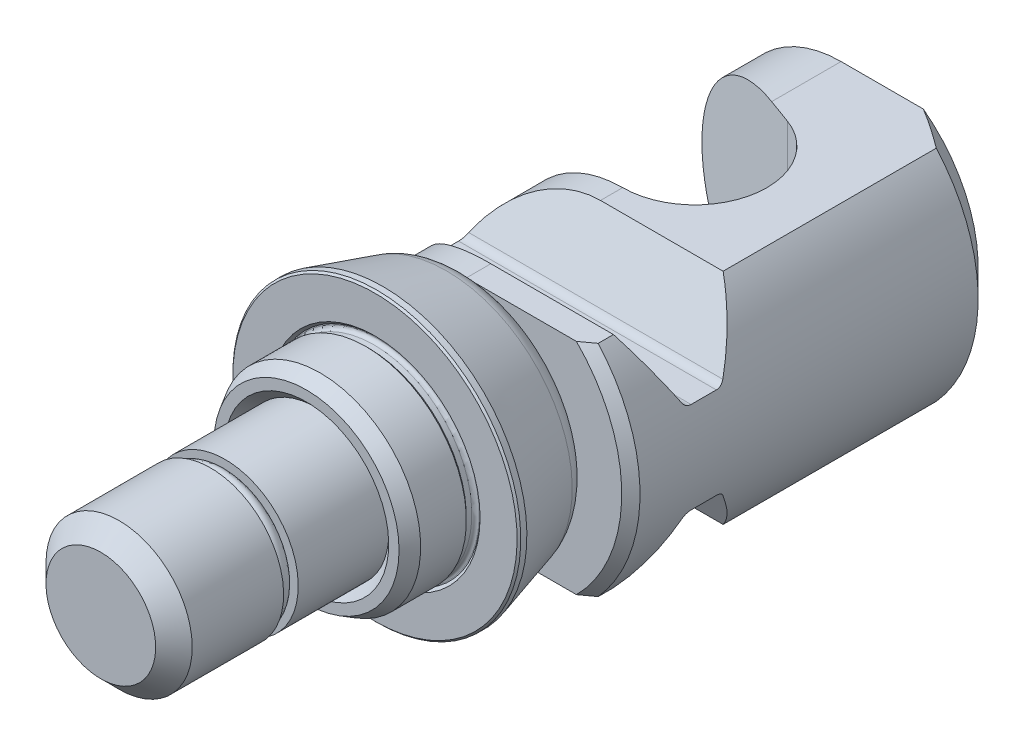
ISO-10303-21;
HEADER;
FILE_DESCRIPTION(('STEP AP214'),'2;1');
FILE_NAME('part.step','',(''),(''),'','','');
FILE_SCHEMA(('AUTOMOTIVE_DESIGN { 1 0 10303 214 1 1 1 1 }'));
ENDSEC;
DATA;
#1=APPLICATION_CONTEXT('core data for automotive mechanical design processes');
#2=APPLICATION_PROTOCOL_DEFINITION('international standard','automotive_design',2000,#1);
#3=PRODUCT_CONTEXT('',#1,'mechanical');
#4=PRODUCT('Part','Part','',(#3));
#5=PRODUCT_RELATED_PRODUCT_CATEGORY('part','',(#4));
#6=PRODUCT_DEFINITION_FORMATION('','',#4);
#7=PRODUCT_DEFINITION_CONTEXT('part definition',#1,'design');
#8=PRODUCT_DEFINITION('design','',#6,#7);
#9=PRODUCT_DEFINITION_SHAPE('','',#8);
#10=(LENGTH_UNIT() NAMED_UNIT(*) SI_UNIT(.MILLI.,.METRE.));
#11=(NAMED_UNIT(*) PLANE_ANGLE_UNIT() SI_UNIT($,.RADIAN.));
#12=(NAMED_UNIT(*) SI_UNIT($,.STERADIAN.) SOLID_ANGLE_UNIT());
#13=UNCERTAINTY_MEASURE_WITH_UNIT(LENGTH_MEASURE(1.E-05),#10,'distance_accuracy_value','');
#14=(GEOMETRIC_REPRESENTATION_CONTEXT(3) GLOBAL_UNCERTAINTY_ASSIGNED_CONTEXT((#13)) GLOBAL_UNIT_ASSIGNED_CONTEXT((#10,
#11,#12)) REPRESENTATION_CONTEXT('',''));
#15=CARTESIAN_POINT('',(0.,0.,0.));
#16=DIRECTION('',(0.,0.,1.));
#17=DIRECTION('',(1.,0.,0.));
#18=AXIS2_PLACEMENT_3D('',#15,#16,#17);
#19=CARTESIAN_POINT('',(6.31086870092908,-2.3948770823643,17.15));
#20=DIRECTION('',(-0.354796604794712,-0.934943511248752,0.));
#21=DIRECTION('',(0.,0.,1.));
#22=AXIS2_PLACEMENT_3D('',#19,#20,#21);
#23=ELLIPSE('',#22,0.75,0.75);
#24=CARTESIAN_POINT('',(0.,0.,17.15));
#25=DIRECTION('',(0.,0.,-1.));
#26=AXIS1_PLACEMENT('',#24,#25);
#27=SURFACE_OF_REVOLUTION('',#23,#26);
#28=CARTESIAN_POINT('',(0.,0.,17.4));
#29=DIRECTION('',(0.,0.,-1.));
#30=DIRECTION('',(0.,1.,0.));
#31=AXIS2_PLACEMENT_3D('',#28,#29,#30);
#32=CIRCLE('',#31,6.04289321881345);
#33=CARTESIAN_POINT('',(0.,6.04289321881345,17.4));
#34=VERTEX_POINT('',#33);
#35=EDGE_CURVE('E9',#34,#34,#32,.F.);
#36=ORIENTED_EDGE('',*,*,#35,.F.);
#37=EDGE_LOOP('',(#36));
#38=FACE_BOUND('',#37,.T.);
#39=CARTESIAN_POINT('',(0.,0.,16.4));
#40=DIRECTION('',(0.,0.,-1.));
#41=DIRECTION('',(0.,1.,0.));
#42=AXIS2_PLACEMENT_3D('',#39,#40,#41);
#43=CIRCLE('',#42,6.75);
#44=CARTESIAN_POINT('',(0.,6.75,16.4));
#45=VERTEX_POINT('',#44);
#46=EDGE_CURVE('E23',#45,#45,#43,.T.);
#47=ORIENTED_EDGE('',*,*,#46,.F.);
#48=EDGE_LOOP('',(#47));
#49=FACE_BOUND('',#48,.T.);
#50=ADVANCED_FACE('F14',(#38,#49),#27,.F.);
#51=CARTESIAN_POINT('',(0.,0.,-50.9));
#52=DIRECTION('',(0.,0.,-1.));
#53=DIRECTION('',(0.,-1.,0.));
#54=AXIS2_PLACEMENT_3D('',#51,#52,#53);
#55=PLANE('',#54);
#56=DIRECTION('',(0.,-1.,0.));
#57=VECTOR('',#56,1.);
#58=CARTESIAN_POINT('',(10.,-3.,-50.9));
#59=LINE('',#58,#57);
#60=CARTESIAN_POINT('',(10.,3.,-50.9));
#61=VERTEX_POINT('',#60);
#62=CARTESIAN_POINT('',(10.,-3.,-50.9));
#63=VERTEX_POINT('',#62);
#64=EDGE_CURVE('E994',#61,#63,#59,.T.);
#65=ORIENTED_EDGE('',*,*,#64,.T.);
#66=DIRECTION('',(-1.,0.,0.));
#67=VECTOR('',#66,1.);
#68=CARTESIAN_POINT('',(0.,-3.,-50.9));
#69=LINE('',#68,#67);
#70=CARTESIAN_POINT('',(0.,-3.,-50.9));
#71=VERTEX_POINT('',#70);
#72=EDGE_CURVE('E227',#63,#71,#69,.T.);
#73=ORIENTED_EDGE('',*,*,#72,.T.);
#74=DIRECTION('',(0.,-1.,0.));
#75=VECTOR('',#74,1.);
#76=CARTESIAN_POINT('',(0.,-7.,-50.9));
#77=LINE('',#76,#75);
#78=CARTESIAN_POINT('',(0.,-7.,-50.9));
#79=VERTEX_POINT('',#78);
#80=EDGE_CURVE('E215',#71,#79,#77,.T.);
#81=ORIENTED_EDGE('',*,*,#80,.T.);
#82=DIRECTION('',(-0.707106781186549,0.707106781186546,0.));
#83=VECTOR('',#82,1.);
#84=CARTESIAN_POINT('',(-7.,0.,-50.9));
#85=LINE('',#84,#83);
#86=CARTESIAN_POINT('',(-7.,0.,-50.9));
#87=VERTEX_POINT('',#86);
#88=EDGE_CURVE('E204',#79,#87,#85,.T.);
#89=ORIENTED_EDGE('',*,*,#88,.T.);
#90=DIRECTION('',(0.707106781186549,0.707106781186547,0.));
#91=VECTOR('',#90,1.);
#92=CARTESIAN_POINT('',(0.,7.,-50.9));
#93=LINE('',#92,#91);
#94=CARTESIAN_POINT('',(0.,7.,-50.9));
#95=VERTEX_POINT('',#94);
#96=EDGE_CURVE('E214',#87,#95,#93,.T.);
#97=ORIENTED_EDGE('',*,*,#96,.T.);
#98=DIRECTION('',(0.,-1.,0.));
#99=VECTOR('',#98,1.);
#100=CARTESIAN_POINT('',(0.,3.,-50.9));
#101=LINE('',#100,#99);
#102=CARTESIAN_POINT('',(0.,3.,-50.9));
#103=VERTEX_POINT('',#102);
#104=EDGE_CURVE('E988',#95,#103,#101,.T.);
#105=ORIENTED_EDGE('',*,*,#104,.T.);
#106=DIRECTION('',(1.,0.,0.));
#107=VECTOR('',#106,1.);
#108=CARTESIAN_POINT('',(10.,3.,-50.9));
#109=LINE('',#108,#107);
#110=EDGE_CURVE('E991',#103,#61,#109,.T.);
#111=ORIENTED_EDGE('',*,*,#110,.T.);
#112=EDGE_LOOP('',(#65,#73,#81,#89,#97,#105,#111));
#113=FACE_BOUND('',#112,.T.);
#114=ADVANCED_FACE('F226',(#113),#55,.T.);
#115=CARTESIAN_POINT('',(0.,7.,-28.7772844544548));
#116=DIRECTION('',(0.707106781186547,-0.707106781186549,0.));
#117=DIRECTION('',(0.707106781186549,0.707106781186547,0.));
#118=AXIS2_PLACEMENT_3D('',#115,#116,#117);
#119=PLANE('',#118);
#120=DIRECTION('',(0.,0.,-1.));
#121=VECTOR('',#120,1.);
#122=CARTESIAN_POINT('',(0.,7.,-28.7772844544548));
#123=LINE('',#122,#121);
#124=CARTESIAN_POINT('',(0.,7.,-51.));
#125=VERTEX_POINT('',#124);
#126=EDGE_CURVE('E999',#95,#125,#123,.T.);
#127=ORIENTED_EDGE('',*,*,#126,.F.);
#128=ORIENTED_EDGE('',*,*,#96,.F.);
#129=DIRECTION('',(0.,0.,-1.));
#130=VECTOR('',#129,1.);
#131=CARTESIAN_POINT('',(-7.,0.,-28.7772844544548));
#132=LINE('',#131,#130);
#133=CARTESIAN_POINT('',(-7.,0.,-51.));
#134=VERTEX_POINT('',#133);
#135=EDGE_CURVE('E210',#87,#134,#132,.T.);
#136=ORIENTED_EDGE('',*,*,#135,.T.);
#137=DIRECTION('',(-0.707106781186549,-0.707106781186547,0.));
#138=VECTOR('',#137,1.);
#139=CARTESIAN_POINT('',(-3.5,3.5,-51.));
#140=LINE('',#139,#138);
#141=EDGE_CURVE('E521',#125,#134,#140,.T.);
#142=ORIENTED_EDGE('',*,*,#141,.F.);
#143=EDGE_LOOP('',(#127,#128,#136,#142));
#144=FACE_BOUND('',#143,.T.);
#145=ADVANCED_FACE('F591',(#144),#119,.T.);
#146=CARTESIAN_POINT('',(0.,3.,-28.7772844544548));
#147=DIRECTION('',(-1.,0.,0.));
#148=DIRECTION('',(0.,-1.,0.));
#149=AXIS2_PLACEMENT_3D('',#146,#147,#148);
#150=PLANE('',#149);
#151=DIRECTION('',(0.,0.,-1.));
#152=VECTOR('',#151,1.);
#153=CARTESIAN_POINT('',(0.,3.,-28.7772844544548));
#154=LINE('',#153,#152);
#155=CARTESIAN_POINT('',(0.,3.,-51.));
#156=VERTEX_POINT('',#155);
#157=EDGE_CURVE('E1002',#103,#156,#154,.T.);
#158=ORIENTED_EDGE('',*,*,#157,.F.);
#159=ORIENTED_EDGE('',*,*,#104,.F.);
#160=ORIENTED_EDGE('',*,*,#126,.T.);
#161=DIRECTION('',(0.,1.,0.));
#162=VECTOR('',#161,1.);
#163=CARTESIAN_POINT('',(0.,0.,-51.));
#164=LINE('',#163,#162);
#165=EDGE_CURVE('E518',#156,#125,#164,.T.);
#166=ORIENTED_EDGE('',*,*,#165,.F.);
#167=EDGE_LOOP('',(#158,#159,#160,#166));
#168=FACE_BOUND('',#167,.T.);
#169=ADVANCED_FACE('F597',(#168),#150,.T.);
#170=CARTESIAN_POINT('',(10.,3.,-28.7772844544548));
#171=DIRECTION('',(0.,-1.,0.));
#172=DIRECTION('',(1.,0.,0.));
#173=AXIS2_PLACEMENT_3D('',#170,#171,#172);
#174=PLANE('',#173);
#175=DIRECTION('',(0.,0.,-1.));
#176=VECTOR('',#175,1.);
#177=CARTESIAN_POINT('',(10.,3.,-28.7772844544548));
#178=LINE('',#177,#176);
#179=CARTESIAN_POINT('',(10.,3.,-51.));
#180=VERTEX_POINT('',#179);
#181=EDGE_CURVE('E230',#61,#180,#178,.T.);
#182=ORIENTED_EDGE('',*,*,#181,.F.);
#183=ORIENTED_EDGE('',*,*,#110,.F.);
#184=ORIENTED_EDGE('',*,*,#157,.T.);
#185=DIRECTION('',(-1.,0.,0.));
#186=VECTOR('',#185,1.);
#187=CARTESIAN_POINT('',(0.,3.,-51.));
#188=LINE('',#187,#186);
#189=EDGE_CURVE('E515',#180,#156,#188,.T.);
#190=ORIENTED_EDGE('',*,*,#189,.F.);
#191=EDGE_LOOP('',(#182,#183,#184,#190));
#192=FACE_BOUND('',#191,.T.);
#193=ADVANCED_FACE('F614',(#192),#174,.T.);
#194=CARTESIAN_POINT('',(10.,-3.,-28.7772844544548));
#195=DIRECTION('',(-1.,0.,0.));
#196=DIRECTION('',(0.,-1.,0.));
#197=AXIS2_PLACEMENT_3D('',#194,#195,#196);
#198=PLANE('',#197);
#199=DIRECTION('',(0.,0.,-1.));
#200=VECTOR('',#199,1.);
#201=CARTESIAN_POINT('',(10.,-3.,-28.7772844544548));
#202=LINE('',#201,#200);
#203=CARTESIAN_POINT('',(10.,-3.,-51.));
#204=VERTEX_POINT('',#203);
#205=EDGE_CURVE('E31',#63,#204,#202,.T.);
#206=ORIENTED_EDGE('',*,*,#205,.F.);
#207=ORIENTED_EDGE('',*,*,#64,.F.);
#208=ORIENTED_EDGE('',*,*,#181,.T.);
#209=DIRECTION('',(0.,1.,0.));
#210=VECTOR('',#209,1.);
#211=CARTESIAN_POINT('',(10.,0.,-51.));
#212=LINE('',#211,#210);
#213=EDGE_CURVE('E512',#204,#180,#212,.T.);
#214=ORIENTED_EDGE('',*,*,#213,.F.);
#215=EDGE_LOOP('',(#206,#207,#208,#214));
#216=FACE_BOUND('',#215,.T.);
#217=ADVANCED_FACE('F618',(#216),#198,.T.);
#218=CARTESIAN_POINT('',(0.,-3.,-28.7772844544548));
#219=DIRECTION('',(0.,1.,0.));
#220=DIRECTION('',(-1.,0.,0.));
#221=AXIS2_PLACEMENT_3D('',#218,#219,#220);
#222=PLANE('',#221);
#223=DIRECTION('',(0.,0.,-1.));
#224=VECTOR('',#223,1.);
#225=CARTESIAN_POINT('',(0.,-3.,-28.7772844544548));
#226=LINE('',#225,#224);
#227=CARTESIAN_POINT('',(0.,-3.,-51.));
#228=VERTEX_POINT('',#227);
#229=EDGE_CURVE('E223',#71,#228,#226,.T.);
#230=ORIENTED_EDGE('',*,*,#229,.F.);
#231=ORIENTED_EDGE('',*,*,#72,.F.);
#232=ORIENTED_EDGE('',*,*,#205,.T.);
#233=DIRECTION('',(1.,0.,0.));
#234=VECTOR('',#233,1.);
#235=CARTESIAN_POINT('',(0.,-3.,-51.));
#236=LINE('',#235,#234);
#237=EDGE_CURVE('E509',#228,#204,#236,.T.);
#238=ORIENTED_EDGE('',*,*,#237,.F.);
#239=EDGE_LOOP('',(#230,#231,#232,#238));
#240=FACE_BOUND('',#239,.T.);
#241=ADVANCED_FACE('F608',(#240),#222,.T.);
#242=CARTESIAN_POINT('',(0.,-7.,-28.7772844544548));
#243=DIRECTION('',(-1.,0.,0.));
#244=DIRECTION('',(0.,-1.,0.));
#245=AXIS2_PLACEMENT_3D('',#242,#243,#244);
#246=PLANE('',#245);
#247=DIRECTION('',(0.,0.,-1.));
#248=VECTOR('',#247,1.);
#249=CARTESIAN_POINT('',(0.,-7.,-28.7772844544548));
#250=LINE('',#249,#248);
#251=CARTESIAN_POINT('',(0.,-7.,-51.));
#252=VERTEX_POINT('',#251);
#253=EDGE_CURVE('E207',#79,#252,#250,.T.);
#254=ORIENTED_EDGE('',*,*,#253,.F.);
#255=ORIENTED_EDGE('',*,*,#80,.F.);
#256=ORIENTED_EDGE('',*,*,#229,.T.);
#257=DIRECTION('',(0.,1.,0.));
#258=VECTOR('',#257,1.);
#259=CARTESIAN_POINT('',(0.,0.,-51.));
#260=LINE('',#259,#258);
#261=EDGE_CURVE('E222',#252,#228,#260,.T.);
#262=ORIENTED_EDGE('',*,*,#261,.F.);
#263=EDGE_LOOP('',(#254,#255,#256,#262));
#264=FACE_BOUND('',#263,.T.);
#265=ADVANCED_FACE('F218',(#264),#246,.T.);
#266=CARTESIAN_POINT('',(-7.,0.,-28.7772844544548));
#267=DIRECTION('',(0.707106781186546,0.707106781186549,0.));
#268=DIRECTION('',(-0.707106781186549,0.707106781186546,0.));
#269=AXIS2_PLACEMENT_3D('',#266,#267,#268);
#270=PLANE('',#269);
#271=ORIENTED_EDGE('',*,*,#135,.F.);
#272=ORIENTED_EDGE('',*,*,#88,.F.);
#273=ORIENTED_EDGE('',*,*,#253,.T.);
#274=DIRECTION('',(0.707106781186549,-0.707106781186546,0.));
#275=VECTOR('',#274,1.);
#276=CARTESIAN_POINT('',(-3.5,-3.5,-51.));
#277=LINE('',#276,#275);
#278=EDGE_CURVE('E524',#134,#252,#277,.T.);
#279=ORIENTED_EDGE('',*,*,#278,.F.);
#280=EDGE_LOOP('',(#271,#272,#273,#279));
#281=FACE_BOUND('',#280,.T.);
#282=ADVANCED_FACE('F206',(#281),#270,.T.);
#283=CARTESIAN_POINT('',(0.,-15.,-35.));
#284=DIRECTION('',(0.,1.,0.));
#285=DIRECTION('',(-1.,0.,0.));
#286=AXIS2_PLACEMENT_3D('',#283,#284,#285);
#287=CYLINDRICAL_SURFACE('',#286,7.9);
#288=DIRECTION('',(0.,1.,0.));
#289=VECTOR('',#288,1.);
#290=CARTESIAN_POINT('',(2.70195913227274,-15.,-42.4235717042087));
#291=LINE('',#290,#289);
#292=CARTESIAN_POINT('',(2.70195913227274,-12.,-42.4235717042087));
#293=VERTEX_POINT('',#292);
#294=CARTESIAN_POINT('',(2.70195913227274,12.,-42.4235717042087));
#295=VERTEX_POINT('',#294);
#296=EDGE_CURVE('E269',#293,#295,#291,.T.);
#297=ORIENTED_EDGE('',*,*,#296,.F.);
#298=CARTESIAN_POINT('',(0.,-12.,-35.));
#299=DIRECTION('',(0.,1.,0.));
#300=DIRECTION('',(0.,0.,-1.));
#301=AXIS2_PLACEMENT_3D('',#298,#299,#300);
#302=CIRCLE('',#301,7.9);
#303=CARTESIAN_POINT('',(0.,-12.,-27.1));
#304=VERTEX_POINT('',#303);
#305=EDGE_CURVE('E327',#304,#293,#302,.T.);
#306=ORIENTED_EDGE('',*,*,#305,.F.);
#307=DIRECTION('',(0.,1.,0.));
#308=VECTOR('',#307,1.);
#309=CARTESIAN_POINT('',(0.,-15.,-27.1));
#310=LINE('',#309,#308);
#311=CARTESIAN_POINT('',(0.,12.,-27.1));
#312=VERTEX_POINT('',#311);
#313=EDGE_CURVE('E270',#304,#312,#310,.T.);
#314=ORIENTED_EDGE('',*,*,#313,.T.);
#315=CARTESIAN_POINT('',(0.,12.,-35.));
#316=DIRECTION('',(0.,-1.,0.));
#317=DIRECTION('',(0.,0.,1.));
#318=AXIS2_PLACEMENT_3D('',#315,#316,#317);
#319=CIRCLE('',#318,7.9);
#320=EDGE_CURVE('E281',#295,#312,#319,.T.);
#321=ORIENTED_EDGE('',*,*,#320,.F.);
#322=EDGE_LOOP('',(#297,#306,#314,#321));
#323=FACE_BOUND('',#322,.T.);
#324=ADVANCED_FACE('F610',(#323),#287,.F.);
#325=CARTESIAN_POINT('',(-12.,-15.,-47.7746472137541));
#326=DIRECTION('',(0.342020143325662,0.,-0.939692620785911));
#327=DIRECTION('',(-0.939692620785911,0.,-0.342020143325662));
#328=AXIS2_PLACEMENT_3D('',#325,#326,#327);
#329=PLANE('',#328);
#330=CARTESIAN_POINT('',(0.,0.,-43.4070044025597));
#331=DIRECTION('',(0.342020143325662,0.,-0.939692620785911));
#332=DIRECTION('',(0.939692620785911,0.,0.342020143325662));
#333=AXIS2_PLACEMENT_3D('',#330,#331,#332);
#334=ELLIPSE('',#333,12.7701332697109,12.);
#335=CARTESIAN_POINT('',(0.,-12.,-43.4070044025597));
#336=VERTEX_POINT('',#335);
#337=CARTESIAN_POINT('',(0.,12.,-43.4070044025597));
#338=VERTEX_POINT('',#337);
#339=EDGE_CURVE('E321',#336,#338,#334,.T.);
#340=ORIENTED_EDGE('',*,*,#339,.F.);
#341=DIRECTION('',(-0.939692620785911,0.,-0.342020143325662));
#342=VECTOR('',#341,1.);
#343=CARTESIAN_POINT('',(19.6352137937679,-12.,-36.2603710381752));
#344=LINE('',#343,#342);
#345=EDGE_CURVE('E273',#293,#336,#344,.T.);
#346=ORIENTED_EDGE('',*,*,#345,.F.);
#347=ORIENTED_EDGE('',*,*,#296,.T.);
#348=DIRECTION('',(0.939692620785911,0.,0.342020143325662));
#349=VECTOR('',#348,1.);
#350=CARTESIAN_POINT('',(19.6352137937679,12.,-36.2603710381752));
#351=LINE('',#350,#349);
#352=EDGE_CURVE('E278',#338,#295,#351,.T.);
#353=ORIENTED_EDGE('',*,*,#352,.F.);
#354=EDGE_LOOP('',(#340,#346,#347,#353));
#355=FACE_BOUND('',#354,.T.);
#356=ADVANCED_FACE('F660',(#355),#329,.F.);
#357=CARTESIAN_POINT('',(0.,0.,-51.));
#358=DIRECTION('',(0.,0.,1.));
#359=DIRECTION('',(0.,1.,0.));
#360=AXIS2_PLACEMENT_3D('',#357,#358,#359);
#361=CYLINDRICAL_SURFACE('',#360,12.);
#362=DIRECTION('',(0.,0.,1.));
#363=VECTOR('',#362,1.);
#364=CARTESIAN_POINT('',(0.,-12.,-51.));
#365=LINE('',#364,#363);
#366=CARTESIAN_POINT('',(0.,-12.,-51.));
#367=VERTEX_POINT('',#366);
#368=EDGE_CURVE('E297',#367,#336,#365,.T.);
#369=ORIENTED_EDGE('',*,*,#368,.T.);
#370=ORIENTED_EDGE('',*,*,#339,.T.);
#371=DIRECTION('',(0.,0.,1.));
#372=VECTOR('',#371,1.);
#373=CARTESIAN_POINT('',(0.,12.,-51.));
#374=LINE('',#373,#372);
#375=CARTESIAN_POINT('',(0.,12.,-51.));
#376=VERTEX_POINT('',#375);
#377=EDGE_CURVE('E291',#376,#338,#374,.T.);
#378=ORIENTED_EDGE('',*,*,#377,.F.);
#379=CARTESIAN_POINT('',(0.,0.,-51.));
#380=DIRECTION('',(0.,0.,-1.));
#381=DIRECTION('',(0.,1.,0.));
#382=AXIS2_PLACEMENT_3D('',#379,#380,#381);
#383=CIRCLE('',#382,12.);
#384=EDGE_CURVE('E285',#367,#376,#383,.T.);
#385=ORIENTED_EDGE('',*,*,#384,.F.);
#386=EDGE_LOOP('',(#369,#370,#378,#385));
#387=FACE_BOUND('',#386,.T.);
#388=ADVANCED_FACE('F383',(#387),#361,.T.);
#389=CARTESIAN_POINT('',(0.,0.,-51.));
#390=DIRECTION('',(0.,0.,-1.));
#391=DIRECTION('',(0.,-1.,0.));
#392=AXIS2_PLACEMENT_3D('',#389,#390,#391);
#393=PLANE('',#392);
#394=DIRECTION('',(-1.,0.,0.));
#395=VECTOR('',#394,1.);
#396=CARTESIAN_POINT('',(25.,12.,-51.));
#397=LINE('',#396,#395);
#398=CARTESIAN_POINT('',(9.,12.,-51.));
#399=VERTEX_POINT('',#398);
#400=EDGE_CURVE('E294',#399,#376,#397,.T.);
#401=ORIENTED_EDGE('',*,*,#400,.F.);
#402=CARTESIAN_POINT('',(0.,0.,-51.));
#403=DIRECTION('',(0.,0.,-1.));
#404=DIRECTION('',(0.,-1.,0.));
#405=AXIS2_PLACEMENT_3D('',#402,#403,#404);
#406=CIRCLE('',#405,15.);
#407=CARTESIAN_POINT('',(9.,-12.,-51.));
#408=VERTEX_POINT('',#407);
#409=EDGE_CURVE('E489',#399,#408,#406,.T.);
#410=ORIENTED_EDGE('',*,*,#409,.T.);
#411=DIRECTION('',(-1.,0.,0.));
#412=VECTOR('',#411,1.);
#413=CARTESIAN_POINT('',(25.,-12.,-51.));
#414=LINE('',#413,#412);
#415=EDGE_CURVE('E305',#408,#367,#414,.T.);
#416=ORIENTED_EDGE('',*,*,#415,.T.);
#417=ORIENTED_EDGE('',*,*,#384,.T.);
#418=EDGE_LOOP('',(#401,#410,#416,#417));
#419=FACE_BOUND('',#418,.T.);
#420=ORIENTED_EDGE('',*,*,#278,.T.);
#421=ORIENTED_EDGE('',*,*,#261,.T.);
#422=ORIENTED_EDGE('',*,*,#237,.T.);
#423=ORIENTED_EDGE('',*,*,#213,.T.);
#424=ORIENTED_EDGE('',*,*,#189,.T.);
#425=ORIENTED_EDGE('',*,*,#165,.T.);
#426=ORIENTED_EDGE('',*,*,#141,.T.);
#427=EDGE_LOOP('',(#420,#421,#422,#423,#424,#425,#426));
#428=FACE_BOUND('',#427,.T.);
#429=ADVANCED_FACE('F434',(#419,#428),#393,.T.);
#430=CARTESIAN_POINT('',(0.,0.,-51.));
#431=DIRECTION('',(0.,0.,1.));
#432=DIRECTION('',(0.,1.,0.));
#433=AXIS2_PLACEMENT_3D('',#430,#431,#432);
#434=CONICAL_SURFACE('',#433,15.,0.785398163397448);
#435=CARTESIAN_POINT('',(13.4164078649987,12.,-48.));
#436=CARTESIAN_POINT('',(13.2379347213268,12.,-48.1330229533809));
#437=CARTESIAN_POINT('',(13.0588994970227,12.,-48.2652917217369));
#438=CARTESIAN_POINT('',(12.6996067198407,12.,-48.5281656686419));
#439=CARTESIAN_POINT('',(12.5193491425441,12.,-48.6587708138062));
#440=CARTESIAN_POINT('',(11.9768349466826,12.,-49.0476861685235));
#441=CARTESIAN_POINT('',(11.6126116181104,12.,-49.3032647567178));
#442=CARTESIAN_POINT('',(10.8780044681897,12.,-49.8055842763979));
#443=CARTESIAN_POINT('',(10.5076196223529,12.,-50.0523237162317));
#444=CARTESIAN_POINT('',(9.94662003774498,12.,-50.4142738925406));
#445=CARTESIAN_POINT('',(9.75865749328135,12.,-50.5335997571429));
#446=CARTESIAN_POINT('',(9.38080671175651,12.,-50.7691839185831));
#447=CARTESIAN_POINT('',(9.19091837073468,12.,-50.8854420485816));
#448=CARTESIAN_POINT('',(9.,12.,-51.));
#449=B_SPLINE_CURVE_WITH_KNOTS('',3,(#435,#436,#437,#438,#439,#440,#441,#442,#443,#444,#445,
#446,#447,#448),.UNSPECIFIED.,.F.,.F.,(4,2,2,2,2,2,4),(0.,0.667776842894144,1.33556706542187,
2.67030383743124,4.00526480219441,4.67315848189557,5.34108841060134),.UNSPECIFIED.);
#450=CARTESIAN_POINT('',(13.4164078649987,12.,-48.));
#451=VERTEX_POINT('',#450);
#452=EDGE_CURVE('E502',#451,#399,#449,.T.);
#453=ORIENTED_EDGE('',*,*,#452,.F.);
#454=CARTESIAN_POINT('',(0.,0.,-48.));
#455=DIRECTION('',(0.,0.,-1.));
#456=DIRECTION('',(0.,-1.,0.));
#457=AXIS2_PLACEMENT_3D('',#454,#455,#456);
#458=CIRCLE('',#457,18.);
#459=CARTESIAN_POINT('',(13.4164078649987,-12.,-48.));
#460=VERTEX_POINT('',#459);
#461=EDGE_CURVE('E39',#460,#451,#458,.F.);
#462=ORIENTED_EDGE('',*,*,#461,.F.);
#463=CARTESIAN_POINT('',(9.,-12.,-51.));
#464=CARTESIAN_POINT('',(9.19091837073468,-12.,-50.8854420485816));
#465=CARTESIAN_POINT('',(9.38080671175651,-12.,-50.7691839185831));
#466=CARTESIAN_POINT('',(9.75865749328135,-12.,-50.5335997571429));
#467=CARTESIAN_POINT('',(9.94662003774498,-12.,-50.4142738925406));
#468=CARTESIAN_POINT('',(10.5076196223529,-12.,-50.0523237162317));
#469=CARTESIAN_POINT('',(10.8780044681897,-12.,-49.8055842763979));
#470=CARTESIAN_POINT('',(11.6126116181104,-12.,-49.3032647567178));
#471=CARTESIAN_POINT('',(11.9768349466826,-12.,-49.0476861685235));
#472=CARTESIAN_POINT('',(12.5193491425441,-12.,-48.6587708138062));
#473=CARTESIAN_POINT('',(12.6996067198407,-12.,-48.5281656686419));
#474=CARTESIAN_POINT('',(13.0588994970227,-12.,-48.2652917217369));
#475=CARTESIAN_POINT('',(13.2379347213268,-12.,-48.133022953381));
#476=CARTESIAN_POINT('',(13.4164078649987,-12.,-48.));
#477=B_SPLINE_CURVE_WITH_KNOTS('',3,(#463,#464,#465,#466,#467,#468,#469,#470,#471,#472,#473,
#474,#475,#476),.UNSPECIFIED.,.F.,.F.,(4,2,2,2,2,2,4),(0.,0.667929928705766,1.33582360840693,
2.67078457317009,4.00552134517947,4.67331156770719,5.34108841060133),.UNSPECIFIED.);
#478=EDGE_CURVE('E1023',#408,#460,#477,.T.);
#479=ORIENTED_EDGE('',*,*,#478,.F.);
#480=ORIENTED_EDGE('',*,*,#409,.F.);
#481=EDGE_LOOP('',(#453,#462,#479,#480));
#482=FACE_BOUND('',#481,.T.);
#483=ADVANCED_FACE('F393',(#482),#434,.T.);
#484=CARTESIAN_POINT('',(25.,6.,-20.056624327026));
#485=DIRECTION('',(1.,0.,0.));
#486=DIRECTION('',(0.,1.,0.));
#487=AXIS2_PLACEMENT_3D('',#484,#485,#486);
#488=CYLINDRICAL_SURFACE('',#487,1.);
#489=CARTESIAN_POINT('',(17.1391365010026,5.5,-20.9226497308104));
#490=CARTESIAN_POINT('',(17.1468134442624,5.47607777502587,-20.9088379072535));
#491=CARTESIAN_POINT('',(17.1542650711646,5.45268396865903,-20.8940092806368));
#492=CARTESIAN_POINT('',(17.1686862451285,5.40710483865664,-20.8623822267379));
#493=CARTESIAN_POINT('',(17.1756557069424,5.38491972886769,-20.8455834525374));
#494=CARTESIAN_POINT('',(17.1957772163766,5.32045742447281,-20.7923685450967));
#495=CARTESIAN_POINT('',(17.2081567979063,5.28022815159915,-20.7531078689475));
#496=CARTESIAN_POINT('',(17.2305783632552,5.2065978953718,-20.6679269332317));
#497=CARTESIAN_POINT('',(17.2406155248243,5.17321101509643,-20.6219932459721));
#498=CARTESIAN_POINT('',(17.2581078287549,5.11455292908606,-20.5248160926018));
#499=CARTESIAN_POINT('',(17.2655651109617,5.08927499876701,-20.4735770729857));
#500=CARTESIAN_POINT('',(17.27824135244,5.04608091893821,-20.3629431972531));
#501=CARTESIAN_POINT('',(17.2832337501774,5.02891472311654,-20.3032238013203));
#502=CARTESIAN_POINT('',(17.2882514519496,5.01162584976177,-20.2118374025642));
#503=CARTESIAN_POINT('',(17.2895122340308,5.00727274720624,-20.1809773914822));
#504=CARTESIAN_POINT('',(17.2911945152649,5.00145947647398,-20.1189598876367));
#505=CARTESIAN_POINT('',(17.2916159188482,4.99999963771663,-20.0878023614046));
#506=CARTESIAN_POINT('',(17.2916164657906,5.,-20.056624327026));
#507=B_SPLINE_CURVE_WITH_KNOTS('',3,(#489,#490,#491,#492,#493,#494,#495,#496,#497,#498,#499,
#500,#501,#502,#503,#504,#505,#506),.UNSPECIFIED.,.F.,.F.,(4,2,2,2,2,2,2,2,4),(0.,
0.0859625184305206,0.171940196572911,0.343735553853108,0.51588151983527,0.687884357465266,
0.873635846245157,0.967081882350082,1.06053855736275),.UNSPECIFIED.);
#508=CARTESIAN_POINT('',(17.1391365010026,5.5,-20.9226497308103));
#509=VERTEX_POINT('',#508);
#510=CARTESIAN_POINT('',(17.2916164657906,5.,-20.056624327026));
#511=VERTEX_POINT('',#510);
#512=EDGE_CURVE('E376',#509,#511,#507,.T.);
#513=ORIENTED_EDGE('',*,*,#512,.F.);
#514=DIRECTION('',(-1.,0.,0.));
#515=VECTOR('',#514,1.);
#516=CARTESIAN_POINT('',(17.2916164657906,5.5,-20.9226497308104));
#517=LINE('',#516,#515);
#518=CARTESIAN_POINT('',(-10.6653645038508,5.5,-20.9226497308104));
#519=VERTEX_POINT('',#518);
#520=EDGE_CURVE('E353',#519,#509,#517,.F.);
#521=ORIENTED_EDGE('',*,*,#520,.F.);
#522=CARTESIAN_POINT('',(-10.9087121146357,5.,-20.056624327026));
#523=CARTESIAN_POINT('',(-10.9087119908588,4.99999901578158,-20.0828050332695));
#524=CARTESIAN_POINT('',(-10.9082405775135,5.00102890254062,-20.1089726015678));
#525=CARTESIAN_POINT('',(-10.9063598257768,5.00512966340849,-20.1611082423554));
#526=CARTESIAN_POINT('',(-10.9049506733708,5.0082001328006,-20.187076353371));
#527=CARTESIAN_POINT('',(-10.8993375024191,5.02041102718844,-20.2642421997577));
#528=CARTESIAN_POINT('',(-10.8937476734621,5.03255129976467,-20.3149021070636));
#529=CARTESIAN_POINT('',(-10.8790192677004,5.06431057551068,-20.4132166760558));
#530=CARTESIAN_POINT('',(-10.8698816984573,5.08392745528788,-20.460872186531));
#531=CARTESIAN_POINT('',(-10.848284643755,5.12985004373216,-20.5520481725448));
#532=CARTESIAN_POINT('',(-10.8358234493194,5.1561591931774,-20.5955665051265));
#533=CARTESIAN_POINT('',(-10.8074414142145,5.21539261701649,-20.6787847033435));
#534=CARTESIAN_POINT('',(-10.791423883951,5.2484993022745,-20.7183209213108));
#535=CARTESIAN_POINT('',(-10.7565491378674,5.31960642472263,-20.7912367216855));
#536=CARTESIAN_POINT('',(-10.7376929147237,5.35760515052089,-20.8246184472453));
#537=CARTESIAN_POINT('',(-10.7093127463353,5.41396025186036,-20.8671724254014));
#538=CARTESIAN_POINT('',(-10.700780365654,5.43080742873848,-20.8790856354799));
#539=CARTESIAN_POINT('',(-10.6833469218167,5.46502205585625,-20.9017383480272));
#540=CARTESIAN_POINT('',(-10.6744467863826,5.48238816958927,-20.9124805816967));
#541=CARTESIAN_POINT('',(-10.6653645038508,5.5,-20.9226497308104));
#542=B_SPLINE_CURVE_WITH_KNOTS('',3,(#522,#523,#524,#525,#526,#527,#528,#529,#530,#531,#532,
#533,#534,#535,#536,#537,#538,#539,#540,#541),.UNSPECIFIED.,.F.,.F.,(4,2,2,2,2,2,2,2,2,4),(0.,
0.0784918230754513,0.156968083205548,0.313326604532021,0.469640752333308,0.62603543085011,
0.787360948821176,0.948630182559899,1.01558382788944,1.08237780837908),.UNSPECIFIED.);
#543=CARTESIAN_POINT('',(-10.9087121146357,5.,-20.056624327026));
#544=VERTEX_POINT('',#543);
#545=EDGE_CURVE('E368',#544,#519,#542,.T.);
#546=ORIENTED_EDGE('',*,*,#545,.F.);
#547=DIRECTION('',(-1.,0.,0.));
#548=VECTOR('',#547,1.);
#549=CARTESIAN_POINT('',(-10.9087121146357,5.,-20.056624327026));
#550=LINE('',#549,#548);
#551=EDGE_CURVE('E350',#511,#544,#550,.T.);
#552=ORIENTED_EDGE('',*,*,#551,.F.);
#553=EDGE_LOOP('',(#513,#521,#546,#552));
#554=FACE_BOUND('',#553,.T.);
#555=ADVANCED_FACE('F387',(#554),#488,.F.);
#556=CARTESIAN_POINT('',(25.,5.,-16.7168783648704));
#557=DIRECTION('',(0.,1.,0.));
#558=DIRECTION('',(0.,0.,-1.));
#559=AXIS2_PLACEMENT_3D('',#556,#557,#558);
#560=PLANE('',#559);
#561=DIRECTION('',(0.,0.,-1.));
#562=VECTOR('',#561,1.);
#563=CARTESIAN_POINT('',(17.2916164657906,5.,-10.));
#564=LINE('',#563,#562);
#565=CARTESIAN_POINT('',(17.2916164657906,5.,-17.2942286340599));
#566=VERTEX_POINT('',#565);
#567=EDGE_CURVE('E342',#511,#566,#564,.F.);
#568=ORIENTED_EDGE('',*,*,#567,.F.);
#569=ORIENTED_EDGE('',*,*,#551,.T.);
#570=DIRECTION('',(0.,0.,1.));
#571=VECTOR('',#570,1.);
#572=CARTESIAN_POINT('',(-10.9087121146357,5.,-51.));
#573=LINE('',#572,#571);
#574=CARTESIAN_POINT('',(-10.9087121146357,5.,-17.2942286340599));
#575=VERTEX_POINT('',#574);
#576=EDGE_CURVE('E253',#544,#575,#573,.T.);
#577=ORIENTED_EDGE('',*,*,#576,.T.);
#578=DIRECTION('',(-1.,0.,0.));
#579=VECTOR('',#578,1.);
#580=CARTESIAN_POINT('',(17.2916164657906,5.,-17.2942286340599));
#581=LINE('',#580,#579);
#582=EDGE_CURVE('E348',#575,#566,#581,.F.);
#583=ORIENTED_EDGE('',*,*,#582,.T.);
#584=EDGE_LOOP('',(#568,#569,#577,#583));
#585=FACE_BOUND('',#584,.T.);
#586=ADVANCED_FACE('F392',(#585),#560,.T.);
#587=CARTESIAN_POINT('',(25.,6.,-17.2942286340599));
#588=DIRECTION('',(1.,0.,0.));
#589=DIRECTION('',(0.,1.,0.));
#590=AXIS2_PLACEMENT_3D('',#587,#588,#589);
#591=CYLINDRICAL_SURFACE('',#590,1.);
#592=CARTESIAN_POINT('',(17.2916164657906,5.,-17.2942286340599));
#593=CARTESIAN_POINT('',(17.291616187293,4.99999964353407,-17.2669410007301));
#594=CARTESIAN_POINT('',(17.2912933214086,5.00111767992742,-17.2396666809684));
#595=CARTESIAN_POINT('',(17.2900038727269,5.00557429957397,-17.1853184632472));
#596=CARTESIAN_POINT('',(17.2890373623,5.00891263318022,-17.1582445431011));
#597=CARTESIAN_POINT('',(17.2851817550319,5.02220888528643,-17.0777275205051));
#598=CARTESIAN_POINT('',(17.2813365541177,5.03544827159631,-17.0248322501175));
#599=CARTESIAN_POINT('',(17.2711655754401,5.07022323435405,-16.9221271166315));
#600=CARTESIAN_POINT('',(17.2648395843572,5.09175952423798,-16.8723175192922));
#601=CARTESIAN_POINT('',(17.2498202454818,5.14241151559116,-16.7770720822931));
#602=CARTESIAN_POINT('',(17.2411257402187,5.17153092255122,-16.731638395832));
#603=CARTESIAN_POINT('',(17.2213892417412,5.23688208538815,-16.6456823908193));
#604=CARTESIAN_POINT('',(17.2103137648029,5.2732146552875,-16.6052446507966));
#605=CARTESIAN_POINT('',(17.1861248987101,5.35152097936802,-16.5310941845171));
#606=CARTESIAN_POINT('',(17.1730143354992,5.39348690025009,-16.4973722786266));
#607=CARTESIAN_POINT('',(17.1525775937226,5.45798018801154,-16.4534992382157));
#608=CARTESIAN_POINT('',(17.1459432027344,5.47879086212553,-16.4404414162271));
#609=CARTESIAN_POINT('',(17.1391365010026,5.5,-16.4282032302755));
#610=B_SPLINE_CURVE_WITH_KNOTS('',3,(#592,#593,#594,#595,#596,#597,#598,#599,#600,#601,#602,
#603,#604,#605,#606,#607,#608,#609),.UNSPECIFIED.,.F.,.F.,(4,2,2,2,2,2,2,2,4),(0.,
0.0818117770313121,0.163614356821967,0.326754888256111,0.48990945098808,0.653143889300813,
0.818844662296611,0.98431736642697,1.06058686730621),.UNSPECIFIED.);
#611=CARTESIAN_POINT('',(17.1391365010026,5.5,-16.4282032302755));
#612=VERTEX_POINT('',#611);
#613=EDGE_CURVE('E413',#566,#612,#610,.T.);
#614=ORIENTED_EDGE('',*,*,#613,.F.);
#615=ORIENTED_EDGE('',*,*,#582,.F.);
#616=CARTESIAN_POINT('',(-10.6653645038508,5.5,-16.4282032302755));
#617=CARTESIAN_POINT('',(-10.6774347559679,5.47659477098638,-16.4417173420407));
#618=CARTESIAN_POINT('',(-10.6891836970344,5.45362151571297,-16.4562460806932));
#619=CARTESIAN_POINT('',(-10.7119857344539,5.40869623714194,-16.4873163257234));
#620=CARTESIAN_POINT('',(-10.7230384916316,5.38674471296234,-16.5038588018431));
#621=CARTESIAN_POINT('',(-10.7550987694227,5.32260575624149,-16.5565320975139));
#622=CARTESIAN_POINT('',(-10.7749588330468,5.28223029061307,-16.5956537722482));
#623=CARTESIAN_POINT('',(-10.8110922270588,5.20787932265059,-16.6812277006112));
#624=CARTESIAN_POINT('',(-10.8273544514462,5.17392368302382,-16.7277019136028));
#625=CARTESIAN_POINT('',(-10.8557255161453,5.11412973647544,-16.8267152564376));
#626=CARTESIAN_POINT('',(-10.8678390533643,5.08828225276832,-16.879247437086));
#627=CARTESIAN_POINT('',(-10.8868237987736,5.04752786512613,-16.9847697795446));
#628=CARTESIAN_POINT('',(-10.8940116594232,5.03196310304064,-17.0374500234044));
#629=CARTESIAN_POINT('',(-10.9042731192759,5.00968918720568,-17.144960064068));
#630=CARTESIAN_POINT('',(-10.9073566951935,5.00295855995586,-17.1997843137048));
#631=CARTESIAN_POINT('',(-10.9085935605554,5.00025823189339,-17.2679013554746));
#632=CARTESIAN_POINT('',(-10.9087129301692,4.99999754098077,-17.2810680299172));
#633=CARTESIAN_POINT('',(-10.9087121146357,5.,-17.2942286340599));
#634=B_SPLINE_CURVE_WITH_KNOTS('',3,(#616,#617,#618,#619,#620,#621,#622,#623,#624,#625,#626,
#627,#628,#629,#630,#631,#632,#633),.UNSPECIFIED.,.F.,.F.,(4,2,2,2,2,2,2,2,4),(0.,
0.0887543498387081,0.177551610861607,0.355506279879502,0.534002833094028,0.712296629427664,
0.877651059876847,1.04260280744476,1.08209840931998),.UNSPECIFIED.);
#635=CARTESIAN_POINT('',(-10.6653645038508,5.5,-16.4282032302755));
#636=VERTEX_POINT('',#635);
#637=EDGE_CURVE('E407',#636,#575,#634,.T.);
#638=ORIENTED_EDGE('',*,*,#637,.F.);
#639=DIRECTION('',(-1.,0.,0.));
#640=VECTOR('',#639,1.);
#641=CARTESIAN_POINT('',(-10.9087121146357,5.5,-16.4282032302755));
#642=LINE('',#641,#640);
#643=EDGE_CURVE('E355',#612,#636,#642,.T.);
#644=ORIENTED_EDGE('',*,*,#643,.F.);
#645=EDGE_LOOP('',(#614,#615,#638,#644));
#646=FACE_BOUND('',#645,.T.);
#647=ADVANCED_FACE('F397',(#646),#591,.F.);
#648=CARTESIAN_POINT('',(25.,-6.,-17.2942286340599));
#649=DIRECTION('',(1.,0.,0.));
#650=DIRECTION('',(0.,1.,0.));
#651=AXIS2_PLACEMENT_3D('',#648,#649,#650);
#652=CYLINDRICAL_SURFACE('',#651,1.);
#653=CARTESIAN_POINT('',(17.1391365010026,-5.5,-16.4282032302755));
#654=CARTESIAN_POINT('',(17.1468134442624,-5.47607777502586,-16.4420150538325));
#655=CARTESIAN_POINT('',(17.1542650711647,-5.45268396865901,-16.4568436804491));
#656=CARTESIAN_POINT('',(17.1686862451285,-5.40710483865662,-16.488470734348));
#657=CARTESIAN_POINT('',(17.1756557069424,-5.38491972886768,-16.5052695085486));
#658=CARTESIAN_POINT('',(17.1957772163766,-5.3204574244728,-16.5584844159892));
#659=CARTESIAN_POINT('',(17.2081567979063,-5.28022815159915,-16.5977450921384));
#660=CARTESIAN_POINT('',(17.2305783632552,-5.2065978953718,-16.6829260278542));
#661=CARTESIAN_POINT('',(17.2406155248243,-5.17321101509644,-16.7288597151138));
#662=CARTESIAN_POINT('',(17.2581078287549,-5.11455292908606,-16.8260368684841));
#663=CARTESIAN_POINT('',(17.2655651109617,-5.08927499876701,-16.8772758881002));
#664=CARTESIAN_POINT('',(17.27824135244,-5.04608091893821,-16.9879097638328));
#665=CARTESIAN_POINT('',(17.2832337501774,-5.02891472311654,-17.0476291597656));
#666=CARTESIAN_POINT('',(17.2882514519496,-5.01162584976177,-17.1390155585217));
#667=CARTESIAN_POINT('',(17.2895122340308,-5.00727274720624,-17.1698755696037));
#668=CARTESIAN_POINT('',(17.2911945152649,-5.00145947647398,-17.2318930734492));
#669=CARTESIAN_POINT('',(17.2916159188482,-4.99999963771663,-17.2630505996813));
#670=CARTESIAN_POINT('',(17.2916164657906,-5.,-17.2942286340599));
#671=B_SPLINE_CURVE_WITH_KNOTS('',3,(#653,#654,#655,#656,#657,#658,#659,#660,#661,#662,#663,
#664,#665,#666,#667,#668,#669,#670),.UNSPECIFIED.,.F.,.F.,(4,2,2,2,2,2,2,2,4),(0.,
0.0859625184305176,0.1719401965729,0.343735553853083,0.515881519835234,0.687884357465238,
0.873635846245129,0.967081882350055,1.06053855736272),.UNSPECIFIED.);
#672=CARTESIAN_POINT('',(17.1391365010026,-5.5,-16.4282032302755));
#673=VERTEX_POINT('',#672);
#674=CARTESIAN_POINT('',(17.2916164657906,-5.,-17.2942286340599));
#675=VERTEX_POINT('',#674);
#676=EDGE_CURVE('E440',#673,#675,#671,.T.);
#677=ORIENTED_EDGE('',*,*,#676,.F.);
#678=DIRECTION('',(-1.,0.,0.));
#679=VECTOR('',#678,1.);
#680=CARTESIAN_POINT('',(17.2916164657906,-5.5,-16.4282032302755));
#681=LINE('',#680,#679);
#682=CARTESIAN_POINT('',(-10.6653645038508,-5.5,-16.4282032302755));
#683=VERTEX_POINT('',#682);
#684=EDGE_CURVE('E363',#683,#673,#681,.F.);
#685=ORIENTED_EDGE('',*,*,#684,.F.);
#686=CARTESIAN_POINT('',(-10.9087121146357,-5.,-17.2942286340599));
#687=CARTESIAN_POINT('',(-10.9087119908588,-4.99999901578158,-17.2680479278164));
#688=CARTESIAN_POINT('',(-10.9082405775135,-5.00102890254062,-17.2418803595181));
#689=CARTESIAN_POINT('',(-10.9063598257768,-5.00512966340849,-17.1897447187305));
#690=CARTESIAN_POINT('',(-10.9049506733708,-5.0082001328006,-17.1637766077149));
#691=CARTESIAN_POINT('',(-10.8993375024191,-5.02041102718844,-17.0866107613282));
#692=CARTESIAN_POINT('',(-10.8937476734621,-5.03255129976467,-17.0359508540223));
#693=CARTESIAN_POINT('',(-10.8790192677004,-5.06431057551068,-16.9376362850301));
#694=CARTESIAN_POINT('',(-10.8698816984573,-5.08392745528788,-16.8899807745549));
#695=CARTESIAN_POINT('',(-10.848284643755,-5.12985004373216,-16.7988047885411));
#696=CARTESIAN_POINT('',(-10.8358234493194,-5.15615919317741,-16.7552864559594));
#697=CARTESIAN_POINT('',(-10.8074414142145,-5.21539261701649,-16.6720682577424));
#698=CARTESIAN_POINT('',(-10.791423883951,-5.24849930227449,-16.6325320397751));
#699=CARTESIAN_POINT('',(-10.7565491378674,-5.31960642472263,-16.5596162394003));
#700=CARTESIAN_POINT('',(-10.7376929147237,-5.35760515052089,-16.5262345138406));
#701=CARTESIAN_POINT('',(-10.7093127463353,-5.41396025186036,-16.4836805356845));
#702=CARTESIAN_POINT('',(-10.700780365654,-5.43080742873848,-16.471767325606));
#703=CARTESIAN_POINT('',(-10.6833469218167,-5.46502205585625,-16.4491146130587));
#704=CARTESIAN_POINT('',(-10.6744467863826,-5.48238816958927,-16.4383723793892));
#705=CARTESIAN_POINT('',(-10.6653645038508,-5.5,-16.4282032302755));
#706=B_SPLINE_CURVE_WITH_KNOTS('',3,(#686,#687,#688,#689,#690,#691,#692,#693,#694,#695,#696,
#697,#698,#699,#700,#701,#702,#703,#704,#705),.UNSPECIFIED.,.F.,.F.,(4,2,2,2,2,2,2,2,2,4),(0.,
0.0784918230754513,0.156968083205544,0.313326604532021,0.469640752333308,0.626035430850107,
0.787360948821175,0.948630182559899,1.01558382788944,1.08237780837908),.UNSPECIFIED.);
#707=CARTESIAN_POINT('',(-10.9087121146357,-5.,-17.2942286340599));
#708=VERTEX_POINT('',#707);
#709=EDGE_CURVE('E419',#708,#683,#706,.T.);
#710=ORIENTED_EDGE('',*,*,#709,.F.);
#711=DIRECTION('',(-1.,0.,0.));
#712=VECTOR('',#711,1.);
#713=CARTESIAN_POINT('',(-10.9087121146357,-5.,-17.2942286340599));
#714=LINE('',#713,#712);
#715=EDGE_CURVE('E360',#675,#708,#714,.T.);
#716=ORIENTED_EDGE('',*,*,#715,.F.);
#717=EDGE_LOOP('',(#677,#685,#710,#716));
#718=FACE_BOUND('',#717,.T.);
#719=ADVANCED_FACE('F402',(#718),#652,.F.);
#720=CARTESIAN_POINT('',(25.,-5.,-16.7168783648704));
#721=DIRECTION('',(0.,1.,0.));
#722=DIRECTION('',(0.,0.,-1.));
#723=AXIS2_PLACEMENT_3D('',#720,#721,#722);
#724=PLANE('',#723);
#725=DIRECTION('',(0.,0.,-1.));
#726=VECTOR('',#725,1.);
#727=CARTESIAN_POINT('',(17.2916164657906,-5.,-10.));
#728=LINE('',#727,#726);
#729=CARTESIAN_POINT('',(17.2916164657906,-5.,-20.056624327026));
#730=VERTEX_POINT('',#729);
#731=EDGE_CURVE('E336',#730,#675,#728,.F.);
#732=ORIENTED_EDGE('',*,*,#731,.T.);
#733=ORIENTED_EDGE('',*,*,#715,.T.);
#734=DIRECTION('',(0.,0.,1.));
#735=VECTOR('',#734,1.);
#736=CARTESIAN_POINT('',(-10.9087121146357,-5.,-51.));
#737=LINE('',#736,#735);
#738=CARTESIAN_POINT('',(-10.9087121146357,-5.,-20.056624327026));
#739=VERTEX_POINT('',#738);
#740=EDGE_CURVE('E266',#739,#708,#737,.T.);
#741=ORIENTED_EDGE('',*,*,#740,.F.);
#742=DIRECTION('',(-1.,0.,0.));
#743=VECTOR('',#742,1.);
#744=CARTESIAN_POINT('',(17.2916164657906,-5.,-20.056624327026));
#745=LINE('',#744,#743);
#746=EDGE_CURVE('E358',#739,#730,#745,.F.);
#747=ORIENTED_EDGE('',*,*,#746,.T.);
#748=EDGE_LOOP('',(#732,#733,#741,#747));
#749=FACE_BOUND('',#748,.T.);
#750=ADVANCED_FACE('F462',(#749),#724,.F.);
#751=CARTESIAN_POINT('',(25.,-6.,-20.056624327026));
#752=DIRECTION('',(1.,0.,0.));
#753=DIRECTION('',(0.,1.,0.));
#754=AXIS2_PLACEMENT_3D('',#751,#752,#753);
#755=CYLINDRICAL_SURFACE('',#754,1.);
#756=CARTESIAN_POINT('',(17.2916164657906,-5.,-20.056624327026));
#757=CARTESIAN_POINT('',(17.291616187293,-4.99999964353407,-20.0839119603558));
#758=CARTESIAN_POINT('',(17.2912933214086,-5.00111767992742,-20.1111862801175));
#759=CARTESIAN_POINT('',(17.2900038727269,-5.00557429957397,-20.1655344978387));
#760=CARTESIAN_POINT('',(17.2890373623,-5.00891263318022,-20.1926084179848));
#761=CARTESIAN_POINT('',(17.2851817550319,-5.02220888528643,-20.2731254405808));
#762=CARTESIAN_POINT('',(17.2813365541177,-5.03544827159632,-20.3260207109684));
#763=CARTESIAN_POINT('',(17.2711655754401,-5.07022323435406,-20.4287258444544));
#764=CARTESIAN_POINT('',(17.2648395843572,-5.09175952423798,-20.4785354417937));
#765=CARTESIAN_POINT('',(17.2498202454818,-5.14241151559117,-20.5737808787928));
#766=CARTESIAN_POINT('',(17.2411257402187,-5.17153092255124,-20.6192145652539));
#767=CARTESIAN_POINT('',(17.2213892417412,-5.23688208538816,-20.7051705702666));
#768=CARTESIAN_POINT('',(17.2103137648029,-5.2732146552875,-20.7456083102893));
#769=CARTESIAN_POINT('',(17.1861248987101,-5.35152097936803,-20.8197587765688));
#770=CARTESIAN_POINT('',(17.1730143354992,-5.3934869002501,-20.8534806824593));
#771=CARTESIAN_POINT('',(17.1525775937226,-5.45798018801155,-20.8973537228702));
#772=CARTESIAN_POINT('',(17.1459432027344,-5.47879086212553,-20.9104115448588));
#773=CARTESIAN_POINT('',(17.1391365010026,-5.5,-20.9226497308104));
#774=B_SPLINE_CURVE_WITH_KNOTS('',3,(#756,#757,#758,#759,#760,#761,#762,#763,#764,#765,#766,
#767,#768,#769,#770,#771,#772,#773),.UNSPECIFIED.,.F.,.F.,(4,2,2,2,2,2,2,2,4),(0.,
0.0818117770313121,0.163614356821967,0.326754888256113,0.489909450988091,0.65314388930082,
0.818844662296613,0.984317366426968,1.06058686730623),.UNSPECIFIED.);
#775=CARTESIAN_POINT('',(17.1391365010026,-5.5,-20.9226497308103));
#776=VERTEX_POINT('',#775);
#777=EDGE_CURVE('E451',#730,#776,#774,.T.);
#778=ORIENTED_EDGE('',*,*,#777,.F.);
#779=ORIENTED_EDGE('',*,*,#746,.F.);
#780=CARTESIAN_POINT('',(-10.6653645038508,-5.5,-20.9226497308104));
#781=CARTESIAN_POINT('',(-10.6774347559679,-5.47659477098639,-20.9091356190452));
#782=CARTESIAN_POINT('',(-10.6891836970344,-5.45362151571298,-20.8946068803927));
#783=CARTESIAN_POINT('',(-10.7119857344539,-5.40869623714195,-20.8635366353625));
#784=CARTESIAN_POINT('',(-10.7230384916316,-5.38674471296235,-20.8469941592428));
#785=CARTESIAN_POINT('',(-10.7550987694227,-5.3226057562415,-20.794320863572));
#786=CARTESIAN_POINT('',(-10.7749588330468,-5.28223029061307,-20.7551991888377));
#787=CARTESIAN_POINT('',(-10.8110922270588,-5.20787932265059,-20.6696252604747));
#788=CARTESIAN_POINT('',(-10.8273544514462,-5.17392368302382,-20.6231510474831));
#789=CARTESIAN_POINT('',(-10.8557255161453,-5.11412973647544,-20.5241377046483));
#790=CARTESIAN_POINT('',(-10.8678390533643,-5.08828225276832,-20.4716055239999));
#791=CARTESIAN_POINT('',(-10.8868237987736,-5.04752786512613,-20.3660831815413));
#792=CARTESIAN_POINT('',(-10.8940116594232,-5.03196310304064,-20.3134029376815));
#793=CARTESIAN_POINT('',(-10.9042731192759,-5.00968918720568,-20.2058928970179));
#794=CARTESIAN_POINT('',(-10.9073566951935,-5.00295855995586,-20.1510686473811));
#795=CARTESIAN_POINT('',(-10.9085935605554,-5.00025823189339,-20.0829516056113));
#796=CARTESIAN_POINT('',(-10.9087129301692,-4.99999754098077,-20.0697849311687));
#797=CARTESIAN_POINT('',(-10.9087121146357,-5.,-20.056624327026));
#798=B_SPLINE_CURVE_WITH_KNOTS('',3,(#780,#781,#782,#783,#784,#785,#786,#787,#788,#789,#790,
#791,#792,#793,#794,#795,#796,#797),.UNSPECIFIED.,.F.,.F.,(4,2,2,2,2,2,2,2,4),(0.,
0.0887543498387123,0.177551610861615,0.355506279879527,0.534002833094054,0.712296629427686,
0.87765105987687,1.04260280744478,1.08209840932),.UNSPECIFIED.);
#799=CARTESIAN_POINT('',(-10.6653645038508,-5.5,-20.9226497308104));
#800=VERTEX_POINT('',#799);
#801=EDGE_CURVE('E446',#800,#739,#798,.T.);
#802=ORIENTED_EDGE('',*,*,#801,.F.);
#803=DIRECTION('',(-1.,0.,0.));
#804=VECTOR('',#803,1.);
#805=CARTESIAN_POINT('',(-10.9087121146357,-5.5,-20.9226497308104));
#806=LINE('',#805,#804);
#807=EDGE_CURVE('E365',#776,#800,#806,.T.);
#808=ORIENTED_EDGE('',*,*,#807,.F.);
#809=EDGE_LOOP('',(#778,#779,#802,#808));
#810=FACE_BOUND('',#809,.T.);
#811=ADVANCED_FACE('F457',(#810),#755,.F.);
#812=CARTESIAN_POINT('',(25.,-5.,-20.6339745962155));
#813=DIRECTION('',(0.,0.5,-0.866025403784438));
#814=DIRECTION('',(0.,-0.866025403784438,-0.5));
#815=AXIS2_PLACEMENT_3D('',#812,#813,#814);
#816=PLANE('',#815);
#817=CARTESIAN_POINT('',(0.,0.,-17.7472232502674));
#818=DIRECTION('',(0.,0.5,-0.866025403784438));
#819=DIRECTION('',(0.,-0.866025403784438,-0.5));
#820=AXIS2_PLACEMENT_3D('',#817,#818,#819);
#821=ELLIPSE('',#820,20.7846096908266,18.);
#822=CARTESIAN_POINT('',(13.4164078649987,-12.,-24.6754264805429));
#823=VERTEX_POINT('',#822);
#824=EDGE_CURVE('E256',#823,#776,#821,.F.);
#825=ORIENTED_EDGE('',*,*,#824,.T.);
#826=ORIENTED_EDGE('',*,*,#807,.T.);
#827=CARTESIAN_POINT('',(0.,0.,-17.7472232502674));
#828=DIRECTION('',(0.,0.5,-0.866025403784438));
#829=DIRECTION('',(0.,0.866025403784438,0.5));
#830=AXIS2_PLACEMENT_3D('',#827,#828,#829);
#831=ELLIPSE('',#830,13.856406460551,12.);
#832=CARTESIAN_POINT('',(0.,-12.,-24.6754264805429));
#833=VERTEX_POINT('',#832);
#834=EDGE_CURVE('E259',#833,#800,#831,.T.);
#835=ORIENTED_EDGE('',*,*,#834,.F.);
#836=DIRECTION('',(-1.,0.,0.));
#837=VECTOR('',#836,1.);
#838=CARTESIAN_POINT('',(25.,-12.,-24.6754264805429));
#839=LINE('',#838,#837);
#840=EDGE_CURVE('E330',#823,#833,#839,.T.);
#841=ORIENTED_EDGE('',*,*,#840,.F.);
#842=EDGE_LOOP('',(#825,#826,#835,#841));
#843=FACE_BOUND('',#842,.T.);
#844=ADVANCED_FACE('F461',(#843),#816,.F.);
#845=CARTESIAN_POINT('',(25.,-12.,-51.));
#846=DIRECTION('',(0.,1.,0.));
#847=DIRECTION('',(0.,0.,-1.));
#848=AXIS2_PLACEMENT_3D('',#845,#846,#847);
#849=PLANE('',#848);
#850=ORIENTED_EDGE('',*,*,#415,.F.);
#851=ORIENTED_EDGE('',*,*,#478,.T.);
#852=DIRECTION('',(0.,0.,-1.));
#853=VECTOR('',#852,1.);
#854=CARTESIAN_POINT('',(13.4164078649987,-12.,-10.));
#855=LINE('',#854,#853);
#856=EDGE_CURVE('E308',#460,#823,#855,.F.);
#857=ORIENTED_EDGE('',*,*,#856,.T.);
#858=ORIENTED_EDGE('',*,*,#840,.T.);
#859=EDGE_CURVE('E300',#304,#833,#365,.T.);
#860=ORIENTED_EDGE('',*,*,#859,.F.);
#861=ORIENTED_EDGE('',*,*,#305,.T.);
#862=ORIENTED_EDGE('',*,*,#345,.T.);
#863=ORIENTED_EDGE('',*,*,#368,.F.);
#864=EDGE_LOOP('',(#850,#851,#857,#858,#860,#861,#862,#863));
#865=FACE_BOUND('',#864,.T.);
#866=ADVANCED_FACE('F498',(#865),#849,.F.);
#867=CARTESIAN_POINT('',(0.,-15.,-27.1));
#868=DIRECTION('',(0.,0.,1.));
#869=DIRECTION('',(0.,1.,0.));
#870=AXIS2_PLACEMENT_3D('',#867,#868,#869);
#871=PLANE('',#870);
#872=ORIENTED_EDGE('',*,*,#313,.F.);
#873=CARTESIAN_POINT('',(0.,0.,-27.1));
#874=DIRECTION('',(0.,0.,1.));
#875=DIRECTION('',(0.,1.,0.));
#876=AXIS2_PLACEMENT_3D('',#873,#874,#875);
#877=CIRCLE('',#876,12.);
#878=EDGE_CURVE('E324',#312,#304,#877,.T.);
#879=ORIENTED_EDGE('',*,*,#878,.F.);
#880=EDGE_LOOP('',(#872,#879));
#881=FACE_BOUND('',#880,.T.);
#882=ADVANCED_FACE('F496',(#881),#871,.F.);
#883=CARTESIAN_POINT('',(25.,12.,-51.));
#884=DIRECTION('',(0.,-1.,0.));
#885=DIRECTION('',(0.,0.,1.));
#886=AXIS2_PLACEMENT_3D('',#883,#884,#885);
#887=PLANE('',#886);
#888=DIRECTION('',(0.,0.,-1.));
#889=VECTOR('',#888,1.);
#890=CARTESIAN_POINT('',(13.4164078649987,12.,-10.));
#891=LINE('',#890,#889);
#892=CARTESIAN_POINT('',(13.4164078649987,12.,-24.6754264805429));
#893=VERTEX_POINT('',#892);
#894=EDGE_CURVE('E302',#893,#451,#891,.T.);
#895=ORIENTED_EDGE('',*,*,#894,.T.);
#896=ORIENTED_EDGE('',*,*,#452,.T.);
#897=ORIENTED_EDGE('',*,*,#400,.T.);
#898=ORIENTED_EDGE('',*,*,#377,.T.);
#899=ORIENTED_EDGE('',*,*,#352,.T.);
#900=ORIENTED_EDGE('',*,*,#320,.T.);
#901=CARTESIAN_POINT('',(0.,12.,-24.6754264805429));
#902=VERTEX_POINT('',#901);
#903=EDGE_CURVE('E295',#312,#902,#374,.T.);
#904=ORIENTED_EDGE('',*,*,#903,.T.);
#905=DIRECTION('',(-1.,0.,0.));
#906=VECTOR('',#905,1.);
#907=CARTESIAN_POINT('',(25.,12.,-24.6754264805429));
#908=LINE('',#907,#906);
#909=EDGE_CURVE('E244',#893,#902,#908,.T.);
#910=ORIENTED_EDGE('',*,*,#909,.F.);
#911=EDGE_LOOP('',(#895,#896,#897,#898,#899,#900,#904,#910));
#912=FACE_BOUND('',#911,.T.);
#913=ADVANCED_FACE('F492',(#912),#887,.F.);
#914=CARTESIAN_POINT('',(25.,5.,-20.6339745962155));
#915=DIRECTION('',(0.,0.5,0.866025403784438));
#916=DIRECTION('',(0.,0.866025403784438,-0.5));
#917=AXIS2_PLACEMENT_3D('',#914,#915,#916);
#918=PLANE('',#917);
#919=CARTESIAN_POINT('',(0.,0.,-17.7472232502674));
#920=DIRECTION('',(0.,0.5,0.866025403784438));
#921=DIRECTION('',(0.,-0.866025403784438,0.5));
#922=AXIS2_PLACEMENT_3D('',#919,#920,#921);
#923=ELLIPSE('',#922,13.856406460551,12.);
#924=EDGE_CURVE('E250',#902,#519,#923,.T.);
#925=ORIENTED_EDGE('',*,*,#924,.T.);
#926=ORIENTED_EDGE('',*,*,#520,.T.);
#927=CARTESIAN_POINT('',(0.,0.,-17.7472232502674));
#928=DIRECTION('',(0.,0.5,0.866025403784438));
#929=DIRECTION('',(0.,0.866025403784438,-0.5));
#930=AXIS2_PLACEMENT_3D('',#927,#928,#929);
#931=ELLIPSE('',#930,20.7846096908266,18.);
#932=EDGE_CURVE('E345',#893,#509,#931,.F.);
#933=ORIENTED_EDGE('',*,*,#932,.F.);
#934=ORIENTED_EDGE('',*,*,#909,.T.);
#935=EDGE_LOOP('',(#925,#926,#933,#934));
#936=FACE_BOUND('',#935,.T.);
#937=ADVANCED_FACE('F495',(#936),#918,.T.);
#938=CARTESIAN_POINT('',(25.,12.,-12.675426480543));
#939=DIRECTION('',(0.,0.5,-0.866025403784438));
#940=DIRECTION('',(0.,-0.866025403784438,-0.5));
#941=AXIS2_PLACEMENT_3D('',#938,#939,#940);
#942=PLANE('',#941);
#943=CARTESIAN_POINT('',(0.,0.,-19.6036297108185));
#944=DIRECTION('',(0.,0.5,-0.866025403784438));
#945=DIRECTION('',(0.,-0.866025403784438,-0.5));
#946=AXIS2_PLACEMENT_3D('',#943,#944,#945);
#947=ELLIPSE('',#946,20.7846096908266,18.);
#948=CARTESIAN_POINT('',(13.4164078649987,12.,-12.6754264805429));
#949=VERTEX_POINT('',#948);
#950=EDGE_CURVE('E339',#612,#949,#947,.F.);
#951=ORIENTED_EDGE('',*,*,#950,.F.);
#952=ORIENTED_EDGE('',*,*,#643,.T.);
#953=CARTESIAN_POINT('',(0.,0.,-19.6036297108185));
#954=DIRECTION('',(0.,0.5,-0.866025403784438));
#955=DIRECTION('',(0.,0.866025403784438,0.5));
#956=AXIS2_PLACEMENT_3D('',#953,#954,#955);
#957=ELLIPSE('',#956,13.856406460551,12.);
#958=CARTESIAN_POINT('',(0.,12.,-12.675426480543));
#959=VERTEX_POINT('',#958);
#960=EDGE_CURVE('E246',#636,#959,#957,.T.);
#961=ORIENTED_EDGE('',*,*,#960,.T.);
#962=DIRECTION('',(-1.,0.,0.));
#963=VECTOR('',#962,1.);
#964=CARTESIAN_POINT('',(25.,12.,-12.675426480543));
#965=LINE('',#964,#963);
#966=EDGE_CURVE('E243',#949,#959,#965,.T.);
#967=ORIENTED_EDGE('',*,*,#966,.F.);
#968=EDGE_LOOP('',(#951,#952,#961,#967));
#969=FACE_BOUND('',#968,.T.);
#970=ADVANCED_FACE('F640',(#969),#942,.T.);
#971=CARTESIAN_POINT('',(25.,-12.,-12.675426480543));
#972=DIRECTION('',(0.,0.5,0.866025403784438));
#973=DIRECTION('',(0.,0.866025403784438,-0.5));
#974=AXIS2_PLACEMENT_3D('',#971,#972,#973);
#975=PLANE('',#974);
#976=CARTESIAN_POINT('',(0.,0.,-19.6036297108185));
#977=DIRECTION('',(0.,0.5,0.866025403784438));
#978=DIRECTION('',(0.,-0.866025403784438,0.5));
#979=AXIS2_PLACEMENT_3D('',#976,#977,#978);
#980=ELLIPSE('',#979,13.856406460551,12.);
#981=CARTESIAN_POINT('',(0.,-12.,-12.675426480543));
#982=VERTEX_POINT('',#981);
#983=EDGE_CURVE('E264',#683,#982,#980,.T.);
#984=ORIENTED_EDGE('',*,*,#983,.F.);
#985=ORIENTED_EDGE('',*,*,#684,.T.);
#986=CARTESIAN_POINT('',(0.,0.,-19.6036297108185));
#987=DIRECTION('',(0.,0.5,0.866025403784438));
#988=DIRECTION('',(0.,0.866025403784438,-0.5));
#989=AXIS2_PLACEMENT_3D('',#986,#987,#988);
#990=ELLIPSE('',#989,20.7846096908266,18.);
#991=CARTESIAN_POINT('',(13.4164078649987,-12.,-12.675426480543));
#992=VERTEX_POINT('',#991);
#993=EDGE_CURVE('E262',#673,#992,#990,.F.);
#994=ORIENTED_EDGE('',*,*,#993,.T.);
#995=DIRECTION('',(1.,0.,0.));
#996=VECTOR('',#995,1.);
#997=CARTESIAN_POINT('',(25.,-12.,-12.675426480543));
#998=LINE('',#997,#996);
#999=EDGE_CURVE('E333',#982,#992,#998,.T.);
#1000=ORIENTED_EDGE('',*,*,#999,.F.);
#1001=EDGE_LOOP('',(#984,#985,#994,#1000));
#1002=FACE_BOUND('',#1001,.T.);
#1003=ADVANCED_FACE('F431',(#1002),#975,.F.);
#1004=CARTESIAN_POINT('',(0.,0.,-10.));
#1005=DIRECTION('',(0.,0.,-1.));
#1006=DIRECTION('',(0.,-1.,0.));
#1007=AXIS2_PLACEMENT_3D('',#1004,#1005,#1006);
#1008=CYLINDRICAL_SURFACE('',#1007,18.);
#1009=ORIENTED_EDGE('',*,*,#856,.F.);
#1010=ORIENTED_EDGE('',*,*,#461,.T.);
#1011=ORIENTED_EDGE('',*,*,#894,.F.);
#1012=ORIENTED_EDGE('',*,*,#932,.T.);
#1013=ORIENTED_EDGE('',*,*,#512,.T.);
#1014=ORIENTED_EDGE('',*,*,#567,.T.);
#1015=ORIENTED_EDGE('',*,*,#613,.T.);
#1016=ORIENTED_EDGE('',*,*,#950,.T.);
#1017=CARTESIAN_POINT('',(13.4164078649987,12.,-11.));
#1018=VERTEX_POINT('',#1017);
#1019=EDGE_CURVE('E303',#1018,#949,#891,.T.);
#1020=ORIENTED_EDGE('',*,*,#1019,.F.);
#1021=CARTESIAN_POINT('',(0.,0.,-11.));
#1022=DIRECTION('',(0.,0.,1.));
#1023=DIRECTION('',(0.,1.,0.));
#1024=AXIS2_PLACEMENT_3D('',#1021,#1022,#1023);
#1025=CIRCLE('',#1024,18.);
#1026=CARTESIAN_POINT('',(13.4164078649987,-12.,-11.));
#1027=VERTEX_POINT('',#1026);
#1028=EDGE_CURVE('E693',#1018,#1027,#1025,.F.);
#1029=ORIENTED_EDGE('',*,*,#1028,.T.);
#1030=EDGE_CURVE('E307',#992,#1027,#855,.F.);
#1031=ORIENTED_EDGE('',*,*,#1030,.F.);
#1032=ORIENTED_EDGE('',*,*,#993,.F.);
#1033=ORIENTED_EDGE('',*,*,#676,.T.);
#1034=ORIENTED_EDGE('',*,*,#731,.F.);
#1035=ORIENTED_EDGE('',*,*,#777,.T.);
#1036=ORIENTED_EDGE('',*,*,#824,.F.);
#1037=EDGE_LOOP('',(#1009,#1010,#1011,#1012,#1013,#1014,#1015,#1016,#1020,#1029,#1031,#1032,
#1033,#1034,#1035,#1036));
#1038=FACE_BOUND('',#1037,.T.);
#1039=ADVANCED_FACE('F425',(#1038),#1008,.T.);
#1040=ORIENTED_EDGE('',*,*,#924,.F.);
#1041=ORIENTED_EDGE('',*,*,#903,.F.);
#1042=ORIENTED_EDGE('',*,*,#878,.T.);
#1043=ORIENTED_EDGE('',*,*,#859,.T.);
#1044=ORIENTED_EDGE('',*,*,#834,.T.);
#1045=ORIENTED_EDGE('',*,*,#801,.T.);
#1046=ORIENTED_EDGE('',*,*,#740,.T.);
#1047=ORIENTED_EDGE('',*,*,#709,.T.);
#1048=ORIENTED_EDGE('',*,*,#983,.T.);
#1049=CARTESIAN_POINT('',(0.,-12.,-10.));
#1050=VERTEX_POINT('',#1049);
#1051=EDGE_CURVE('E288',#982,#1050,#365,.T.);
#1052=ORIENTED_EDGE('',*,*,#1051,.T.);
#1053=CARTESIAN_POINT('',(0.,0.,-10.));
#1054=DIRECTION('',(0.,0.,-1.));
#1055=DIRECTION('',(0.,1.,0.));
#1056=AXIS2_PLACEMENT_3D('',#1053,#1054,#1055);
#1057=CIRCLE('',#1056,12.);
#1058=CARTESIAN_POINT('',(0.,12.,-10.));
#1059=VERTEX_POINT('',#1058);
#1060=EDGE_CURVE('E284',#1050,#1059,#1057,.T.);
#1061=ORIENTED_EDGE('',*,*,#1060,.T.);
#1062=EDGE_CURVE('E296',#959,#1059,#374,.T.);
#1063=ORIENTED_EDGE('',*,*,#1062,.F.);
#1064=ORIENTED_EDGE('',*,*,#960,.F.);
#1065=ORIENTED_EDGE('',*,*,#637,.T.);
#1066=ORIENTED_EDGE('',*,*,#576,.F.);
#1067=ORIENTED_EDGE('',*,*,#545,.T.);
#1068=EDGE_LOOP('',(#1040,#1041,#1042,#1043,#1044,#1045,#1046,#1047,#1048,#1052,#1061,#1063,
#1064,#1065,#1066,#1067));
#1069=FACE_BOUND('',#1068,.T.);
#1070=ADVANCED_FACE('F430',(#1069),#361,.T.);
#1071=DIRECTION('',(1.,0.,0.));
#1072=VECTOR('',#1071,1.);
#1073=CARTESIAN_POINT('',(0.,12.,-10.));
#1074=LINE('',#1073,#1072);
#1075=CARTESIAN_POINT('',(12.0415945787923,12.,-10.));
#1076=VERTEX_POINT('',#1075);
#1077=EDGE_CURVE('E318',#1059,#1076,#1074,.T.);
#1078=ORIENTED_EDGE('',*,*,#1077,.T.);
#1079=CARTESIAN_POINT('',(12.0415945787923,12.,-10.));
#1080=CARTESIAN_POINT('',(12.1572054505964,12.,-10.0818913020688));
#1081=CARTESIAN_POINT('',(12.272539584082,12.,-10.1641726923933));
#1082=CARTESIAN_POINT('',(12.5026751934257,12.,-10.3294682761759));
#1083=CARTESIAN_POINT('',(12.6174766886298,12.,-10.4124824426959));
#1084=CARTESIAN_POINT('',(12.8465759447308,12.,-10.5792019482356));
#1085=CARTESIAN_POINT('',(12.9608737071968,12.,-10.6629072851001));
#1086=CARTESIAN_POINT('',(13.188993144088,12.,-10.8309729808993));
#1087=CARTESIAN_POINT('',(13.3028148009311,12.,-10.9153333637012));
#1088=CARTESIAN_POINT('',(13.4164078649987,12.,-11.));
#1089=B_SPLINE_CURVE_WITH_KNOTS('',3,(#1079,#1080,#1081,#1082,#1083,#1084,#1085,#1086,#1087,
#1088),.UNSPECIFIED.,.F.,.F.,(4,2,2,2,4),(0.,0.425026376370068,0.85003719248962,
1.27504668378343,1.70007173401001),.UNSPECIFIED.);
#1090=EDGE_CURVE('E483',#1076,#1018,#1089,.T.);
#1091=ORIENTED_EDGE('',*,*,#1090,.T.);
#1092=ORIENTED_EDGE('',*,*,#1019,.T.);
#1093=ORIENTED_EDGE('',*,*,#966,.T.);
#1094=ORIENTED_EDGE('',*,*,#1062,.T.);
#1095=EDGE_LOOP('',(#1078,#1091,#1092,#1093,#1094));
#1096=FACE_BOUND('',#1095,.T.);
#1097=ADVANCED_FACE('F470',(#1096),#887,.F.);
#1098=CARTESIAN_POINT('',(0.,0.,-11.));
#1099=DIRECTION('',(0.,0.,-1.));
#1100=DIRECTION('',(0.,-1.,0.));
#1101=AXIS2_PLACEMENT_3D('',#1098,#1099,#1100);
#1102=CONICAL_SURFACE('',#1101,18.,0.785398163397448);
#1103=ORIENTED_EDGE('',*,*,#1090,.F.);
#1104=CARTESIAN_POINT('',(0.,0.,-10.));
#1105=DIRECTION('',(0.,0.,1.));
#1106=DIRECTION('',(0.,1.,0.));
#1107=AXIS2_PLACEMENT_3D('',#1104,#1105,#1106);
#1108=CIRCLE('',#1107,17.);
#1109=CARTESIAN_POINT('',(12.0415945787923,-12.,-10.));
#1110=VERTEX_POINT('',#1109);
#1111=EDGE_CURVE('E490',#1110,#1076,#1108,.T.);
#1112=ORIENTED_EDGE('',*,*,#1111,.F.);
#1113=CARTESIAN_POINT('',(13.4164078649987,-12.,-11.));
#1114=CARTESIAN_POINT('',(13.3028148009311,-12.,-10.9153333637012));
#1115=CARTESIAN_POINT('',(13.188993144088,-12.,-10.8309729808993));
#1116=CARTESIAN_POINT('',(12.9608737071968,-12.,-10.6629072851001));
#1117=CARTESIAN_POINT('',(12.8465759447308,-12.,-10.5792019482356));
#1118=CARTESIAN_POINT('',(12.6174766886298,-12.,-10.4124824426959));
#1119=CARTESIAN_POINT('',(12.5026751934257,-12.,-10.3294682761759));
#1120=CARTESIAN_POINT('',(12.272539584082,-12.,-10.1641726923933));
#1121=CARTESIAN_POINT('',(12.1572054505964,-12.,-10.0818913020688));
#1122=CARTESIAN_POINT('',(12.0415945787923,-12.,-10.));
#1123=B_SPLINE_CURVE_WITH_KNOTS('',3,(#1113,#1114,#1115,#1116,#1117,#1118,#1119,#1120,#1121,
#1122),.UNSPECIFIED.,.F.,.F.,(4,2,2,2,4),(0.,0.425025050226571,0.85003454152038,
1.27504535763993,1.70007173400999),.UNSPECIFIED.);
#1124=EDGE_CURVE('E476',#1027,#1110,#1123,.T.);
#1125=ORIENTED_EDGE('',*,*,#1124,.F.);
#1126=ORIENTED_EDGE('',*,*,#1028,.F.);
#1127=EDGE_LOOP('',(#1103,#1112,#1125,#1126));
#1128=FACE_BOUND('',#1127,.T.);
#1129=ADVANCED_FACE('F464',(#1128),#1102,.T.);
#1130=ORIENTED_EDGE('',*,*,#1030,.T.);
#1131=ORIENTED_EDGE('',*,*,#1124,.T.);
#1132=DIRECTION('',(-1.,0.,0.));
#1133=VECTOR('',#1132,1.);
#1134=CARTESIAN_POINT('',(0.,-12.,-10.));
#1135=LINE('',#1134,#1133);
#1136=EDGE_CURVE('E316',#1110,#1050,#1135,.T.);
#1137=ORIENTED_EDGE('',*,*,#1136,.T.);
#1138=ORIENTED_EDGE('',*,*,#1051,.F.);
#1139=ORIENTED_EDGE('',*,*,#999,.T.);
#1140=EDGE_LOOP('',(#1130,#1131,#1137,#1138,#1139));
#1141=FACE_BOUND('',#1140,.T.);
#1142=ADVANCED_FACE('F469',(#1141),#849,.F.);
#1143=CARTESIAN_POINT('',(0.,0.,-10.));
#1144=DIRECTION('',(0.,0.,1.));
#1145=DIRECTION('',(0.,1.,0.));
#1146=AXIS2_PLACEMENT_3D('',#1143,#1144,#1145);
#1147=PLANE('',#1146);
#1148=CARTESIAN_POINT('',(0.,0.,-10.));
#1149=DIRECTION('',(0.,0.,-1.));
#1150=DIRECTION('',(0.,1.,0.));
#1151=AXIS2_PLACEMENT_3D('',#1148,#1149,#1150);
#1152=CIRCLE('',#1151,10.8718839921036);
#1153=CARTESIAN_POINT('',(0.,10.8718839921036,-10.));
#1154=VERTEX_POINT('',#1153);
#1155=EDGE_CURVE('E527',#1154,#1154,#1152,.T.);
#1156=ORIENTED_EDGE('',*,*,#1155,.T.);
#1157=EDGE_LOOP('',(#1156));
#1158=FACE_BOUND('',#1157,.T.);
#1159=ORIENTED_EDGE('',*,*,#1136,.F.);
#1160=ORIENTED_EDGE('',*,*,#1111,.T.);
#1161=ORIENTED_EDGE('',*,*,#1077,.F.);
#1162=ORIENTED_EDGE('',*,*,#1060,.F.);
#1163=EDGE_LOOP('',(#1159,#1160,#1161,#1162));
#1164=FACE_BOUND('',#1163,.T.);
#1165=ADVANCED_FACE('F432',(#1158,#1164),#1147,.T.);
#1166=CARTESIAN_POINT('',(0.,0.,-7.));
#1167=DIRECTION('',(0.,0.,-1.));
#1168=DIRECTION('',(0.,1.,0.));
#1169=AXIS2_PLACEMENT_3D('',#1166,#1167,#1168);
#1170=TOROIDAL_SURFACE('',#1169,10.8718839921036,3.);
#1171=CARTESIAN_POINT('',(0.,0.,-7.82691206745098));
#1172=DIRECTION('',(0.,0.,-1.));
#1173=DIRECTION('',(0.,1.,0.));
#1174=AXIS2_PLACEMENT_3D('',#1171,#1172,#1173);
#1175=CIRCLE('',#1174,13.7556690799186);
#1176=CARTESIAN_POINT('',(0.,13.7556690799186,-7.82691206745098));
#1177=VERTEX_POINT('',#1176);
#1178=EDGE_CURVE('E551',#1177,#1177,#1175,.F.);
#1179=ORIENTED_EDGE('',*,*,#1178,.F.);
#1180=EDGE_LOOP('',(#1179));
#1181=FACE_BOUND('',#1180,.T.);
#1182=ORIENTED_EDGE('',*,*,#1155,.F.);
#1183=EDGE_LOOP('',(#1182));
#1184=FACE_BOUND('',#1183,.T.);
#1185=ADVANCED_FACE('F711',(#1181,#1184),#1170,.T.);
#1186=CARTESIAN_POINT('',(0.,0.,-10.));
#1187=DIRECTION('',(0.,0.,1.));
#1188=DIRECTION('',(0.,-1.,0.));
#1189=AXIS2_PLACEMENT_3D('',#1186,#1187,#1188);
#1190=CONICAL_SURFACE('',#1189,13.132546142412,0.279252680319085);
#1191=ORIENTED_EDGE('',*,*,#1178,.T.);
#1192=EDGE_LOOP('',(#1191));
#1193=FACE_BOUND('',#1192,.T.);
#1194=CARTESIAN_POINT('',(0.,0.,-0.871853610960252));
#1195=DIRECTION('',(0.,0.,-1.));
#1196=DIRECTION('',(0.,1.,0.));
#1197=AXIS2_PLACEMENT_3D('',#1194,#1195,#1196);
#1198=CIRCLE('',#1197,15.75);
#1199=CARTESIAN_POINT('',(0.,15.75,-0.871853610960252));
#1200=VERTEX_POINT('',#1199);
#1201=EDGE_CURVE('E548',#1200,#1200,#1198,.T.);
#1202=ORIENTED_EDGE('',*,*,#1201,.T.);
#1203=EDGE_LOOP('',(#1202));
#1204=FACE_BOUND('',#1203,.T.);
#1205=ADVANCED_FACE('F780',(#1193,#1204),#1190,.T.);
#1206=CARTESIAN_POINT('',(0.,0.,0.));
#1207=DIRECTION('',(0.,0.,-1.));
#1208=DIRECTION('',(0.,1.,0.));
#1209=AXIS2_PLACEMENT_3D('',#1206,#1207,#1208);
#1210=CYLINDRICAL_SURFACE('',#1209,15.75);
#1211=CARTESIAN_POINT('',(0.,0.,-0.199999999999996));
#1212=DIRECTION('',(0.,0.,1.));
#1213=DIRECTION('',(0.,-1.,0.));
#1214=AXIS2_PLACEMENT_3D('',#1211,#1212,#1213);
#1215=CIRCLE('',#1214,15.75);
#1216=CARTESIAN_POINT('',(0.,-15.75,-0.199999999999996));
#1217=VERTEX_POINT('',#1216);
#1218=EDGE_CURVE('E563',#1217,#1217,#1215,.F.);
#1219=ORIENTED_EDGE('',*,*,#1218,.T.);
#1220=EDGE_LOOP('',(#1219));
#1221=FACE_BOUND('',#1220,.T.);
#1222=ORIENTED_EDGE('',*,*,#1201,.F.);
#1223=EDGE_LOOP('',(#1222));
#1224=FACE_BOUND('',#1223,.T.);
#1225=ADVANCED_FACE('F791',(#1221,#1224),#1210,.T.);
#1226=CARTESIAN_POINT('',(0.,0.,-0.199999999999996));
#1227=DIRECTION('',(0.,0.,-1.));
#1228=DIRECTION('',(0.,1.,0.));
#1229=AXIS2_PLACEMENT_3D('',#1226,#1227,#1228);
#1230=CONICAL_SURFACE('',#1229,15.75,0.785398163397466);
#1231=CARTESIAN_POINT('',(0.,0.,0.));
#1232=DIRECTION('',(0.,0.,1.));
#1233=DIRECTION('',(0.,-1.,0.));
#1234=AXIS2_PLACEMENT_3D('',#1231,#1232,#1233);
#1235=CIRCLE('',#1234,15.55);
#1236=CARTESIAN_POINT('',(0.,-15.55,0.));
#1237=VERTEX_POINT('',#1236);
#1238=EDGE_CURVE('E566',#1237,#1237,#1235,.T.);
#1239=ORIENTED_EDGE('',*,*,#1238,.F.);
#1240=EDGE_LOOP('',(#1239));
#1241=FACE_BOUND('',#1240,.T.);
#1242=ORIENTED_EDGE('',*,*,#1218,.F.);
#1243=EDGE_LOOP('',(#1242));
#1244=FACE_BOUND('',#1243,.T.);
#1245=ADVANCED_FACE('F802',(#1241,#1244),#1230,.T.);
#1246=CARTESIAN_POINT('',(11.,0.,0.));
#1247=DIRECTION('',(0.,0.,1.));
#1248=DIRECTION('',(0.,-1.,0.));
#1249=AXIS2_PLACEMENT_3D('',#1246,#1247,#1248);
#1250=PLANE('',#1249);
#1251=CARTESIAN_POINT('',(0.,0.,0.));
#1252=DIRECTION('',(0.,0.,-1.));
#1253=DIRECTION('',(0.,1.,0.));
#1254=AXIS2_PLACEMENT_3D('',#1251,#1252,#1253);
#1255=CIRCLE('',#1254,11.5);
#1256=CARTESIAN_POINT('',(0.,11.5,0.));
#1257=VERTEX_POINT('',#1256);
#1258=EDGE_CURVE('E545',#1257,#1257,#1255,.T.);
#1259=ORIENTED_EDGE('',*,*,#1258,.T.);
#1260=EDGE_LOOP('',(#1259));
#1261=FACE_BOUND('',#1260,.T.);
#1262=ORIENTED_EDGE('',*,*,#1238,.T.);
#1263=EDGE_LOOP('',(#1262));
#1264=FACE_BOUND('',#1263,.T.);
#1265=ADVANCED_FACE('F813',(#1261,#1264),#1250,.T.);
#1266=CARTESIAN_POINT('',(0.,0.,-0.3));
#1267=DIRECTION('',(0.,0.,1.));
#1268=DIRECTION('',(0.,-1.,0.));
#1269=AXIS2_PLACEMENT_3D('',#1266,#1267,#1268);
#1270=CONICAL_SURFACE('',#1269,11.2,0.785398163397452);
#1271=ORIENTED_EDGE('',*,*,#1258,.F.);
#1272=EDGE_LOOP('',(#1271));
#1273=FACE_BOUND('',#1272,.T.);
#1274=CARTESIAN_POINT('',(0.,0.,-0.3));
#1275=DIRECTION('',(0.,0.,-1.));
#1276=DIRECTION('',(0.,1.,0.));
#1277=AXIS2_PLACEMENT_3D('',#1274,#1275,#1276);
#1278=CIRCLE('',#1277,11.2);
#1279=CARTESIAN_POINT('',(0.,11.2,-0.3));
#1280=VERTEX_POINT('',#1279);
#1281=EDGE_CURVE('E542',#1280,#1280,#1278,.T.);
#1282=ORIENTED_EDGE('',*,*,#1281,.T.);
#1283=EDGE_LOOP('',(#1282));
#1284=FACE_BOUND('',#1283,.T.);
#1285=ADVANCED_FACE('F588',(#1273,#1284),#1270,.F.);
#1286=CARTESIAN_POINT('',(10.7,0.,-0.3));
#1287=DIRECTION('',(0.,0.,-1.));
#1288=DIRECTION('',(0.,1.,0.));
#1289=AXIS2_PLACEMENT_3D('',#1286,#1287,#1288);
#1290=PLANE('',#1289);
#1291=CARTESIAN_POINT('',(0.,0.,-0.3));
#1292=DIRECTION('',(0.,0.,-1.));
#1293=DIRECTION('',(0.,1.,0.));
#1294=AXIS2_PLACEMENT_3D('',#1291,#1292,#1293);
#1295=CIRCLE('',#1294,11.1);
#1296=CARTESIAN_POINT('',(0.,11.1,-0.3));
#1297=VERTEX_POINT('',#1296);
#1298=EDGE_CURVE('E568',#1297,#1297,#1295,.T.);
#1299=ORIENTED_EDGE('',*,*,#1298,.T.);
#1300=EDGE_LOOP('',(#1299));
#1301=FACE_BOUND('',#1300,.T.);
#1302=ORIENTED_EDGE('',*,*,#1281,.F.);
#1303=EDGE_LOOP('',(#1302));
#1304=FACE_BOUND('',#1303,.T.);
#1305=ADVANCED_FACE('F580',(#1301,#1304),#1290,.F.);
#1306=CARTESIAN_POINT('',(0.,0.,0.1));
#1307=DIRECTION('',(0.,0.,-1.));
#1308=DIRECTION('',(0.,1.,0.));
#1309=AXIS2_PLACEMENT_3D('',#1306,#1307,#1308);
#1310=TOROIDAL_SURFACE('',#1309,11.1,0.4);
#1311=CARTESIAN_POINT('',(0.,0.,0.1));
#1312=DIRECTION('',(0.,0.,-1.));
#1313=DIRECTION('',(0.,1.,0.));
#1314=AXIS2_PLACEMENT_3D('',#1311,#1312,#1313);
#1315=CIRCLE('',#1314,10.7);
#1316=CARTESIAN_POINT('',(0.,10.7,0.1));
#1317=VERTEX_POINT('',#1316);
#1318=EDGE_CURVE('E18',#1317,#1317,#1315,.F.);
#1319=ORIENTED_EDGE('',*,*,#1318,.F.);
#1320=EDGE_LOOP('',(#1319));
#1321=FACE_BOUND('',#1320,.T.);
#1322=ORIENTED_EDGE('',*,*,#1298,.F.);
#1323=EDGE_LOOP('',(#1322));
#1324=FACE_BOUND('',#1323,.T.);
#1325=ADVANCED_FACE('F16',(#1321,#1324),#1310,.F.);
#1326=CARTESIAN_POINT('',(0.,0.,0.));
#1327=DIRECTION('',(0.,0.,-1.));
#1328=DIRECTION('',(0.,1.,0.));
#1329=AXIS2_PLACEMENT_3D('',#1326,#1327,#1328);
#1330=CYLINDRICAL_SURFACE('',#1329,10.7);
#1331=ORIENTED_EDGE('',*,*,#1318,.T.);
#1332=EDGE_LOOP('',(#1331));
#1333=FACE_BOUND('',#1332,.T.);
#1334=CARTESIAN_POINT('',(0.,0.,0.7));
#1335=DIRECTION('',(0.,0.,-1.));
#1336=DIRECTION('',(0.,1.,0.));
#1337=AXIS2_PLACEMENT_3D('',#1334,#1335,#1336);
#1338=CIRCLE('',#1337,10.7);
#1339=CARTESIAN_POINT('',(0.,10.7,0.7));
#1340=VERTEX_POINT('',#1339);
#1341=EDGE_CURVE('E539',#1340,#1340,#1338,.T.);
#1342=ORIENTED_EDGE('',*,*,#1341,.T.);
#1343=EDGE_LOOP('',(#1342));
#1344=FACE_BOUND('',#1343,.T.);
#1345=ADVANCED_FACE('F575',(#1333,#1344),#1330,.T.);
#1346=CARTESIAN_POINT('',(0.,0.,1.));
#1347=DIRECTION('',(0.,0.,1.));
#1348=DIRECTION('',(0.,-1.,0.));
#1349=AXIS2_PLACEMENT_3D('',#1346,#1347,#1348);
#1350=CONICAL_SURFACE('',#1349,11.,0.78539816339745);
#1351=ORIENTED_EDGE('',*,*,#1341,.F.);
#1352=EDGE_LOOP('',(#1351));
#1353=FACE_BOUND('',#1352,.T.);
#1354=CARTESIAN_POINT('',(0.,0.,1.));
#1355=DIRECTION('',(0.,0.,-1.));
#1356=DIRECTION('',(0.,1.,0.));
#1357=AXIS2_PLACEMENT_3D('',#1354,#1355,#1356);
#1358=CIRCLE('',#1357,11.);
#1359=CARTESIAN_POINT('',(0.,11.,1.));
#1360=VERTEX_POINT('',#1359);
#1361=EDGE_CURVE('E536',#1360,#1360,#1358,.T.);
#1362=ORIENTED_EDGE('',*,*,#1361,.T.);
#1363=EDGE_LOOP('',(#1362));
#1364=FACE_BOUND('',#1363,.T.);
#1365=ADVANCED_FACE('F586',(#1353,#1364),#1350,.T.);
#1366=CARTESIAN_POINT('',(0.,0.,0.));
#1367=DIRECTION('',(0.,0.,-1.));
#1368=DIRECTION('',(0.,1.,0.));
#1369=AXIS2_PLACEMENT_3D('',#1366,#1367,#1368);
#1370=CYLINDRICAL_SURFACE('',#1369,11.);
#1371=ORIENTED_EDGE('',*,*,#1361,.F.);
#1372=EDGE_LOOP('',(#1371));
#1373=FACE_BOUND('',#1372,.T.);
#1374=CARTESIAN_POINT('',(0.,0.,6.));
#1375=DIRECTION('',(0.,0.,1.));
#1376=DIRECTION('',(0.,-1.,0.));
#1377=AXIS2_PLACEMENT_3D('',#1374,#1375,#1376);
#1378=CIRCLE('',#1377,11.);
#1379=CARTESIAN_POINT('',(0.,-11.,6.));
#1380=VERTEX_POINT('',#1379);
#1381=EDGE_CURVE('E554',#1380,#1380,#1378,.F.);
#1382=ORIENTED_EDGE('',*,*,#1381,.T.);
#1383=EDGE_LOOP('',(#1382));
#1384=FACE_BOUND('',#1383,.T.);
#1385=ADVANCED_FACE('F862',(#1373,#1384),#1370,.T.);
#1386=CARTESIAN_POINT('',(0.,0.,6.));
#1387=DIRECTION('',(0.,0.,-1.));
#1388=DIRECTION('',(0.,1.,0.));
#1389=AXIS2_PLACEMENT_3D('',#1386,#1387,#1388);
#1390=CONICAL_SURFACE('',#1389,11.,0.523598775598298);
#1391=CARTESIAN_POINT('',(0.,0.,7.5));
#1392=DIRECTION('',(0.,0.,1.));
#1393=DIRECTION('',(0.,-1.,0.));
#1394=AXIS2_PLACEMENT_3D('',#1391,#1392,#1393);
#1395=CIRCLE('',#1394,10.1339745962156);
#1396=CARTESIAN_POINT('',(0.,-10.1339745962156,7.5));
#1397=VERTEX_POINT('',#1396);
#1398=EDGE_CURVE('E557',#1397,#1397,#1395,.T.);
#1399=ORIENTED_EDGE('',*,*,#1398,.F.);
#1400=EDGE_LOOP('',(#1399));
#1401=FACE_BOUND('',#1400,.T.);
#1402=ORIENTED_EDGE('',*,*,#1381,.F.);
#1403=EDGE_LOOP('',(#1402));
#1404=FACE_BOUND('',#1403,.T.);
#1405=ADVANCED_FACE('F872',(#1401,#1404),#1390,.T.);
#1406=CARTESIAN_POINT('',(8.,0.,7.5));
#1407=DIRECTION('',(0.,0.,1.));
#1408=DIRECTION('',(0.,-1.,0.));
#1409=AXIS2_PLACEMENT_3D('',#1406,#1407,#1408);
#1410=PLANE('',#1409);
#1411=CARTESIAN_POINT('',(0.,0.,7.5));
#1412=DIRECTION('',(0.,0.,1.));
#1413=DIRECTION('',(0.,-1.,0.));
#1414=AXIS2_PLACEMENT_3D('',#1411,#1412,#1413);
#1415=CIRCLE('',#1414,9.);
#1416=CARTESIAN_POINT('',(0.,-9.,7.5));
#1417=VERTEX_POINT('',#1416);
#1418=EDGE_CURVE('E560',#1417,#1417,#1415,.F.);
#1419=ORIENTED_EDGE('',*,*,#1418,.T.);
#1420=EDGE_LOOP('',(#1419));
#1421=FACE_BOUND('',#1420,.T.);
#1422=ORIENTED_EDGE('',*,*,#1398,.T.);
#1423=EDGE_LOOP('',(#1422));
#1424=FACE_BOUND('',#1423,.T.);
#1425=ADVANCED_FACE('F883',(#1421,#1424),#1410,.T.);
#1426=CARTESIAN_POINT('',(0.,0.,7.5));
#1427=DIRECTION('',(0.,0.,1.));
#1428=DIRECTION('',(0.,-1.,0.));
#1429=AXIS2_PLACEMENT_3D('',#1426,#1427,#1428);
#1430=CONICAL_SURFACE('',#1429,9.,0.785398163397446);
#1431=CARTESIAN_POINT('',(0.,0.,6.5));
#1432=DIRECTION('',(0.,0.,1.));
#1433=DIRECTION('',(0.,-1.,0.));
#1434=AXIS2_PLACEMENT_3D('',#1431,#1432,#1433);
#1435=CIRCLE('',#1434,8.);
#1436=CARTESIAN_POINT('',(0.,-8.,6.5));
#1437=VERTEX_POINT('',#1436);
#1438=EDGE_CURVE('E533',#1437,#1437,#1435,.F.);
#1439=ORIENTED_EDGE('',*,*,#1438,.T.);
#1440=EDGE_LOOP('',(#1439));
#1441=FACE_BOUND('',#1440,.T.);
#1442=ORIENTED_EDGE('',*,*,#1418,.F.);
#1443=EDGE_LOOP('',(#1442));
#1444=FACE_BOUND('',#1443,.T.);
#1445=ADVANCED_FACE('F894',(#1441,#1444),#1430,.F.);
#1446=CARTESIAN_POINT('',(0.,0.,-10.));
#1447=DIRECTION('',(0.,0.,-1.));
#1448=DIRECTION('',(0.,-1.,0.));
#1449=AXIS2_PLACEMENT_3D('',#1446,#1447,#1448);
#1450=CYLINDRICAL_SURFACE('',#1449,8.);
#1451=ORIENTED_EDGE('',*,*,#1438,.F.);
#1452=EDGE_LOOP('',(#1451));
#1453=FACE_BOUND('',#1452,.T.);
#1454=CARTESIAN_POINT('',(0.,0.,16.4));
#1455=DIRECTION('',(0.,0.,-1.));
#1456=DIRECTION('',(0.,-1.,0.));
#1457=AXIS2_PLACEMENT_3D('',#1454,#1455,#1456);
#1458=CIRCLE('',#1457,8.);
#1459=CARTESIAN_POINT('',(0.,-8.,16.4));
#1460=VERTEX_POINT('',#1459);
#1461=EDGE_CURVE('E240',#1460,#1460,#1458,.T.);
#1462=ORIENTED_EDGE('',*,*,#1461,.T.);
#1463=EDGE_LOOP('',(#1462));
#1464=FACE_BOUND('',#1463,.T.);
#1465=ADVANCED_FACE('F633',(#1453,#1464),#1450,.T.);
#1466=CARTESIAN_POINT('',(-6.,0.,16.4));
#1467=DIRECTION('',(0.,0.,-1.));
#1468=DIRECTION('',(0.,-1.,0.));
#1469=AXIS2_PLACEMENT_3D('',#1466,#1467,#1468);
#1470=PLANE('',#1469);
#1471=ORIENTED_EDGE('',*,*,#46,.T.);
#1472=EDGE_LOOP('',(#1471));
#1473=FACE_BOUND('',#1472,.T.);
#1474=ORIENTED_EDGE('',*,*,#1461,.F.);
#1475=EDGE_LOOP('',(#1474));
#1476=FACE_BOUND('',#1475,.T.);
#1477=ADVANCED_FACE('F603',(#1473,#1476),#1470,.F.);
#1478=CARTESIAN_POINT('',(0.,0.,17.4));
#1479=DIRECTION('',(0.,0.,1.));
#1480=DIRECTION('',(0.,1.,0.));
#1481=AXIS2_PLACEMENT_3D('',#1478,#1479,#1480);
#1482=PLANE('',#1481);
#1483=CARTESIAN_POINT('',(0.,0.,17.4));
#1484=DIRECTION('',(0.,0.,1.));
#1485=DIRECTION('',(0.,1.,0.));
#1486=AXIS2_PLACEMENT_3D('',#1483,#1484,#1485);
#1487=CIRCLE('',#1486,6.);
#1488=CARTESIAN_POINT('',(0.,6.,17.4));
#1489=VERTEX_POINT('',#1488);
#1490=EDGE_CURVE('E528',#1489,#1489,#1487,.T.);
#1491=ORIENTED_EDGE('',*,*,#1490,.F.);
#1492=EDGE_LOOP('',(#1491));
#1493=FACE_BOUND('',#1492,.T.);
#1494=ORIENTED_EDGE('',*,*,#35,.T.);
#1495=EDGE_LOOP('',(#1494));
#1496=FACE_BOUND('',#1495,.T.);
#1497=ADVANCED_FACE('F602',(#1493,#1496),#1482,.T.);
#1498=CARTESIAN_POINT('',(0.,0.,-10.));
#1499=DIRECTION('',(0.,0.,-1.));
#1500=DIRECTION('',(0.,-1.,0.));
#1501=AXIS2_PLACEMENT_3D('',#1498,#1499,#1500);
#1502=CYLINDRICAL_SURFACE('',#1501,6.);
#1503=ORIENTED_EDGE('',*,*,#1490,.T.);
#1504=EDGE_LOOP('',(#1503));
#1505=FACE_BOUND('',#1504,.T.);
#1506=CARTESIAN_POINT('',(0.,0.,18.));
#1507=DIRECTION('',(0.,0.,-1.));
#1508=DIRECTION('',(0.,-1.,0.));
#1509=AXIS2_PLACEMENT_3D('',#1506,#1507,#1508);
#1510=CIRCLE('',#1509,6.);
#1511=CARTESIAN_POINT('',(0.,-6.,18.));
#1512=VERTEX_POINT('',#1511);
#1513=EDGE_CURVE('E234',#1512,#1512,#1510,.T.);
#1514=ORIENTED_EDGE('',*,*,#1513,.T.);
#1515=EDGE_LOOP('',(#1514));
#1516=FACE_BOUND('',#1515,.T.);
#1517=ADVANCED_FACE('F629',(#1505,#1516),#1502,.T.);
#1518=CARTESIAN_POINT('',(-6.,0.,18.));
#1519=DIRECTION('',(0.,0.,1.));
#1520=DIRECTION('',(0.,1.,0.));
#1521=AXIS2_PLACEMENT_3D('',#1518,#1519,#1520);
#1522=PLANE('',#1521);
#1523=ORIENTED_EDGE('',*,*,#1513,.F.);
#1524=EDGE_LOOP('',(#1523));
#1525=FACE_BOUND('',#1524,.T.);
#1526=CARTESIAN_POINT('',(0.,0.,18.));
#1527=DIRECTION('',(0.,0.,-1.));
#1528=DIRECTION('',(0.,-1.,0.));
#1529=AXIS2_PLACEMENT_3D('',#1526,#1527,#1528);
#1530=CIRCLE('',#1529,8.);
#1531=CARTESIAN_POINT('',(0.,-8.,18.));
#1532=VERTEX_POINT('',#1531);
#1533=EDGE_CURVE('E237',#1532,#1532,#1530,.T.);
#1534=ORIENTED_EDGE('',*,*,#1533,.T.);
#1535=EDGE_LOOP('',(#1534));
#1536=FACE_BOUND('',#1535,.T.);
#1537=ADVANCED_FACE('F625',(#1525,#1536),#1522,.F.);
#1538=ORIENTED_EDGE('',*,*,#1533,.F.);
#1539=EDGE_LOOP('',(#1538));
#1540=FACE_BOUND('',#1539,.T.);
#1541=CARTESIAN_POINT('',(0.,0.,28.));
#1542=DIRECTION('',(0.,0.,1.));
#1543=DIRECTION('',(0.,1.,0.));
#1544=AXIS2_PLACEMENT_3D('',#1541,#1542,#1543);
#1545=CIRCLE('',#1544,8.);
#1546=CARTESIAN_POINT('',(0.,8.,28.));
#1547=VERTEX_POINT('',#1546);
#1548=EDGE_CURVE('E310',#1547,#1547,#1545,.F.);
#1549=ORIENTED_EDGE('',*,*,#1548,.T.);
#1550=EDGE_LOOP('',(#1549));
#1551=FACE_BOUND('',#1550,.T.);
#1552=ADVANCED_FACE('F628',(#1540,#1551),#1450,.T.);
#1553=CARTESIAN_POINT('',(0.,0.,28.));
#1554=DIRECTION('',(0.,0.,-1.));
#1555=DIRECTION('',(0.,-1.,0.));
#1556=AXIS2_PLACEMENT_3D('',#1553,#1554,#1555);
#1557=CONICAL_SURFACE('',#1556,8.,0.78539816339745);
#1558=CARTESIAN_POINT('',(0.,0.,30.));
#1559=DIRECTION('',(0.,0.,1.));
#1560=DIRECTION('',(0.,1.,0.));
#1561=AXIS2_PLACEMENT_3D('',#1558,#1559,#1560);
#1562=CIRCLE('',#1561,6.);
#1563=CARTESIAN_POINT('',(0.,6.,30.));
#1564=VERTEX_POINT('',#1563);
#1565=EDGE_CURVE('E313',#1564,#1564,#1562,.T.);
#1566=ORIENTED_EDGE('',*,*,#1565,.F.);
#1567=EDGE_LOOP('',(#1566));
#1568=FACE_BOUND('',#1567,.T.);
#1569=ORIENTED_EDGE('',*,*,#1548,.F.);
#1570=EDGE_LOOP('',(#1569));
#1571=FACE_BOUND('',#1570,.T.);
#1572=ADVANCED_FACE('F395',(#1568,#1571),#1557,.T.);
#1573=CARTESIAN_POINT('',(0.,0.,30.));
#1574=DIRECTION('',(0.,0.,1.));
#1575=DIRECTION('',(0.,1.,0.));
#1576=AXIS2_PLACEMENT_3D('',#1573,#1574,#1575);
#1577=PLANE('',#1576);
#1578=ORIENTED_EDGE('',*,*,#1565,.T.);
#1579=EDGE_LOOP('',(#1578));
#1580=FACE_BOUND('',#1579,.T.);
#1581=ADVANCED_FACE('F930',(#1580),#1577,.T.);
#1582=CLOSED_SHELL('',(#50,#114,#145,#169,#193,#217,#241,#265,#282,#324,#356,#388,#429,#483,
#555,#586,#647,#719,#750,#811,#844,#866,#882,#913,#937,#970,#1003,#1039,#1070,#1097,#1129,#1142,
#1165,#1185,#1205,#1225,#1245,#1265,#1285,#1305,#1325,#1345,#1365,#1385,#1405,#1425,#1445,#1465,
#1477,#1497,#1517,#1537,#1552,#1572,#1581));
#1583=MANIFOLD_SOLID_BREP('B1',#1582);
#1584=ADVANCED_BREP_SHAPE_REPRESENTATION('',(#18,#1583),#14);
#1585=SHAPE_DEFINITION_REPRESENTATION(#9,#1584);
ENDSEC;
END-ISO-10303-21;
